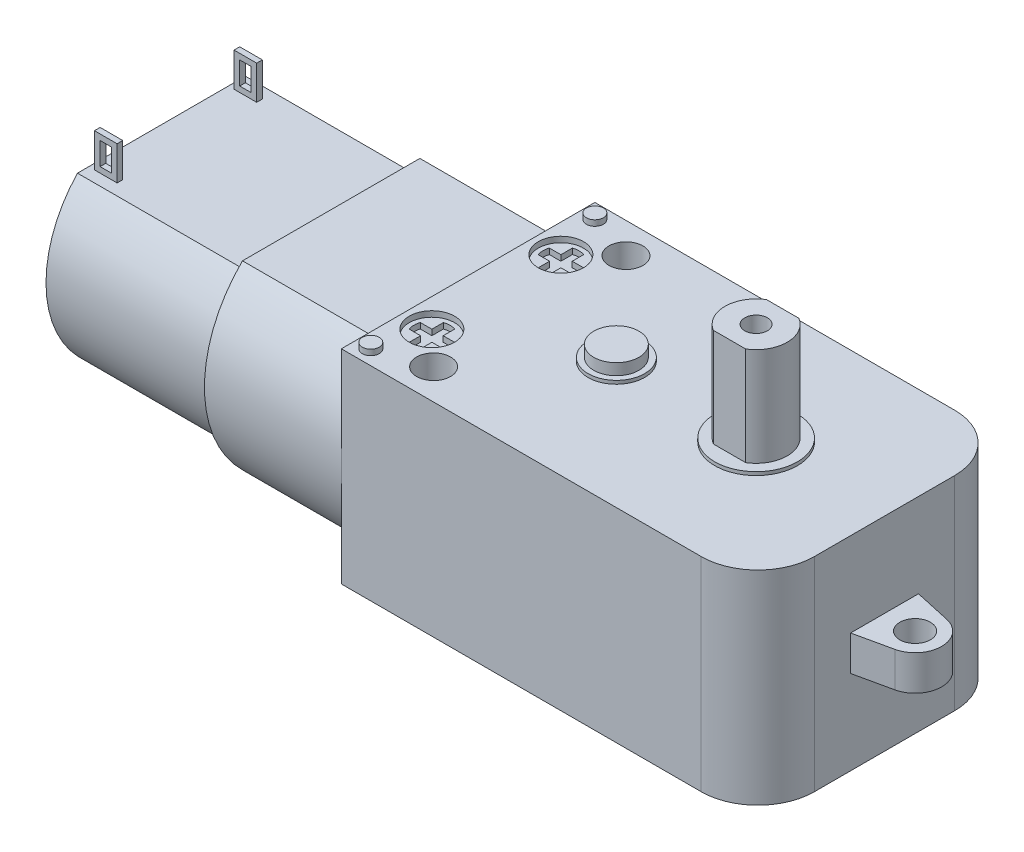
ISO-10303-21;
HEADER;
FILE_DESCRIPTION(('STEP AP214'),'2;1');
FILE_NAME('part.step','',(''),(''),'','','');
FILE_SCHEMA(('AUTOMOTIVE_DESIGN { 1 0 10303 214 1 1 1 1 }'));
ENDSEC;
DATA;
#1=APPLICATION_CONTEXT('core data for automotive mechanical design processes');
#2=APPLICATION_PROTOCOL_DEFINITION('international standard','automotive_design',2000,#1);
#3=PRODUCT_CONTEXT('',#1,'mechanical');
#4=PRODUCT('Part','Part','',(#3));
#5=PRODUCT_RELATED_PRODUCT_CATEGORY('part','',(#4));
#6=PRODUCT_DEFINITION_FORMATION('','',#4);
#7=PRODUCT_DEFINITION_CONTEXT('part definition',#1,'design');
#8=PRODUCT_DEFINITION('design','',#6,#7);
#9=PRODUCT_DEFINITION_SHAPE('','',#8);
#10=(LENGTH_UNIT() NAMED_UNIT(*) SI_UNIT(.MILLI.,.METRE.));
#11=(NAMED_UNIT(*) PLANE_ANGLE_UNIT() SI_UNIT($,.RADIAN.));
#12=(NAMED_UNIT(*) SI_UNIT($,.STERADIAN.) SOLID_ANGLE_UNIT());
#13=UNCERTAINTY_MEASURE_WITH_UNIT(LENGTH_MEASURE(1.E-05),#10,'distance_accuracy_value','');
#14=(GEOMETRIC_REPRESENTATION_CONTEXT(3) GLOBAL_UNCERTAINTY_ASSIGNED_CONTEXT((#13)) GLOBAL_UNIT_ASSIGNED_CONTEXT((#10,
#11,#12)) REPRESENTATION_CONTEXT('',''));
#15=CARTESIAN_POINT('',(0.,0.,0.));
#16=DIRECTION('',(0.,0.,1.));
#17=DIRECTION('',(1.,0.,0.));
#18=AXIS2_PLACEMENT_3D('',#15,#16,#17);
#19=CARTESIAN_POINT('',(-27.1,6.99999999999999,-3.78110520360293));
#20=DIRECTION('',(0.,-1.,0.));
#21=DIRECTION('',(0.,0.,-1.));
#22=AXIS2_PLACEMENT_3D('',#19,#20,#21);
#23=PLANE('',#22);
#24=DIRECTION('',(0.,0.,1.));
#25=VECTOR('',#24,1.);
#26=CARTESIAN_POINT('',(-26.6,7.,-17.6188947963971));
#27=LINE('',#26,#25);
#28=CARTESIAN_POINT('',(-26.6,7.,-17.6188947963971));
#29=VERTEX_POINT('',#28);
#30=CARTESIAN_POINT('',(-26.6,7.,-17.1188947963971));
#31=VERTEX_POINT('',#30);
#32=EDGE_CURVE('E523',#29,#31,#27,.T.);
#33=ORIENTED_EDGE('',*,*,#32,.F.);
#34=DIRECTION('',(-1.,0.,0.));
#35=VECTOR('',#34,1.);
#36=CARTESIAN_POINT('',(-26.6,7.,-17.6188947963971));
#37=LINE('',#36,#35);
#38=CARTESIAN_POINT('',(-24.6,7.,-17.6188947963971));
#39=VERTEX_POINT('',#38);
#40=EDGE_CURVE('E528',#39,#29,#37,.T.);
#41=ORIENTED_EDGE('',*,*,#40,.F.);
#42=DIRECTION('',(0.,0.,-1.));
#43=VECTOR('',#42,1.);
#44=CARTESIAN_POINT('',(-24.6,7.,-17.6188947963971));
#45=LINE('',#44,#43);
#46=CARTESIAN_POINT('',(-24.6,7.,-17.1188947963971));
#47=VERTEX_POINT('',#46);
#48=EDGE_CURVE('E540',#47,#39,#45,.T.);
#49=ORIENTED_EDGE('',*,*,#48,.F.);
#50=DIRECTION('',(1.,0.,0.));
#51=VECTOR('',#50,1.);
#52=CARTESIAN_POINT('',(-26.6,7.,-17.1188947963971));
#53=LINE('',#52,#51);
#54=EDGE_CURVE('E537',#31,#47,#53,.T.);
#55=ORIENTED_EDGE('',*,*,#54,.F.);
#56=EDGE_LOOP('',(#33,#41,#49,#55));
#57=FACE_BOUND('',#56,.T.);
#58=DIRECTION('',(0.,0.,-1.));
#59=VECTOR('',#58,1.);
#60=CARTESIAN_POINT('',(-12.1,6.99999999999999,-3.78110520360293));
#61=LINE('',#60,#59);
#62=CARTESIAN_POINT('',(-12.1,6.99999999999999,-3.78110520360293));
#63=VERTEX_POINT('',#62);
#64=CARTESIAN_POINT('',(-12.1,7.,-18.6188947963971));
#65=VERTEX_POINT('',#64);
#66=EDGE_CURVE('E573',#63,#65,#61,.T.);
#67=ORIENTED_EDGE('',*,*,#66,.T.);
#68=DIRECTION('',(1.,0.,0.));
#69=VECTOR('',#68,1.);
#70=CARTESIAN_POINT('',(-27.1,7.,-18.6188947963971));
#71=LINE('',#70,#69);
#72=CARTESIAN_POINT('',(-27.1,7.,-18.6188947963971));
#73=VERTEX_POINT('',#72);
#74=EDGE_CURVE('E579',#73,#65,#71,.T.);
#75=ORIENTED_EDGE('',*,*,#74,.F.);
#76=DIRECTION('',(0.,0.,-1.));
#77=VECTOR('',#76,1.);
#78=CARTESIAN_POINT('',(-27.1,6.99999999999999,-3.78110520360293));
#79=LINE('',#78,#77);
#80=CARTESIAN_POINT('',(-27.1,6.99999999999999,-3.78110520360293));
#81=VERTEX_POINT('',#80);
#82=EDGE_CURVE('E577',#81,#73,#79,.T.);
#83=ORIENTED_EDGE('',*,*,#82,.F.);
#84=DIRECTION('',(1.,0.,0.));
#85=VECTOR('',#84,1.);
#86=CARTESIAN_POINT('',(-27.1,6.99999999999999,-3.78110520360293));
#87=LINE('',#86,#85);
#88=EDGE_CURVE('E590',#81,#63,#87,.T.);
#89=ORIENTED_EDGE('',*,*,#88,.T.);
#90=EDGE_LOOP('',(#67,#75,#83,#89));
#91=FACE_BOUND('',#90,.T.);
#92=DIRECTION('',(0.,0.,1.));
#93=VECTOR('',#92,1.);
#94=CARTESIAN_POINT('',(-26.6,6.99999999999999,-5.28110520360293));
#95=LINE('',#94,#93);
#96=CARTESIAN_POINT('',(-26.6,6.99999999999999,-5.28110520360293));
#97=VERTEX_POINT('',#96);
#98=CARTESIAN_POINT('',(-26.6,6.99999999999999,-4.78110520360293));
#99=VERTEX_POINT('',#98);
#100=EDGE_CURVE('E490',#97,#99,#95,.T.);
#101=ORIENTED_EDGE('',*,*,#100,.F.);
#102=DIRECTION('',(-1.,0.,0.));
#103=VECTOR('',#102,1.);
#104=CARTESIAN_POINT('',(-26.6,6.99999999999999,-5.28110520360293));
#105=LINE('',#104,#103);
#106=CARTESIAN_POINT('',(-24.6,6.99999999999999,-5.28110520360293));
#107=VERTEX_POINT('',#106);
#108=EDGE_CURVE('E495',#107,#97,#105,.T.);
#109=ORIENTED_EDGE('',*,*,#108,.F.);
#110=DIRECTION('',(0.,0.,-1.));
#111=VECTOR('',#110,1.);
#112=CARTESIAN_POINT('',(-24.6,6.99999999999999,-5.28110520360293));
#113=LINE('',#112,#111);
#114=CARTESIAN_POINT('',(-24.6,6.99999999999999,-4.78110520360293));
#115=VERTEX_POINT('',#114);
#116=EDGE_CURVE('E507',#115,#107,#113,.T.);
#117=ORIENTED_EDGE('',*,*,#116,.F.);
#118=DIRECTION('',(1.,0.,0.));
#119=VECTOR('',#118,1.);
#120=CARTESIAN_POINT('',(-26.6,6.99999999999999,-4.78110520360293));
#121=LINE('',#120,#119);
#122=EDGE_CURVE('E504',#99,#115,#121,.T.);
#123=ORIENTED_EDGE('',*,*,#122,.F.);
#124=EDGE_LOOP('',(#101,#109,#117,#123));
#125=FACE_BOUND('',#124,.T.);
#126=ADVANCED_FACE('F35',(#57,#91,#125),#23,.F.);
#127=CARTESIAN_POINT('',(-12.1,0.,-11.2));
#128=DIRECTION('',(-1.,0.,0.));
#129=DIRECTION('',(0.,0.,1.));
#130=AXIS2_PLACEMENT_3D('',#127,#128,#129);
#131=PLANE('',#130);
#132=CARTESIAN_POINT('',(-12.1,0.,-11.2));
#133=DIRECTION('',(-1.,0.,0.));
#134=DIRECTION('',(0.,0.,1.));
#135=AXIS2_PLACEMENT_3D('',#132,#133,#134);
#136=CIRCLE('',#135,11.2);
#137=CARTESIAN_POINT('',(-12.1,8.,-19.0383671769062));
#138=VERTEX_POINT('',#137);
#139=CARTESIAN_POINT('',(-12.1,-8.,-19.0383671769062));
#140=VERTEX_POINT('',#139);
#141=EDGE_CURVE('E598',#138,#140,#136,.T.);
#142=ORIENTED_EDGE('',*,*,#141,.T.);
#143=DIRECTION('',(0.,0.,1.));
#144=VECTOR('',#143,1.);
#145=CARTESIAN_POINT('',(-12.1,-8.,-3.36163282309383));
#146=LINE('',#145,#144);
#147=CARTESIAN_POINT('',(-12.1,-8.,-3.36163282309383));
#148=VERTEX_POINT('',#147);
#149=EDGE_CURVE('E601',#140,#148,#146,.T.);
#150=ORIENTED_EDGE('',*,*,#149,.T.);
#151=CARTESIAN_POINT('',(-12.1,0.,-11.2));
#152=DIRECTION('',(-1.,0.,0.));
#153=DIRECTION('',(0.,0.,1.));
#154=AXIS2_PLACEMENT_3D('',#151,#152,#153);
#155=CIRCLE('',#154,11.2);
#156=CARTESIAN_POINT('',(-12.1,7.99999999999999,-3.36163282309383));
#157=VERTEX_POINT('',#156);
#158=EDGE_CURVE('E604',#148,#157,#155,.T.);
#159=ORIENTED_EDGE('',*,*,#158,.T.);
#160=DIRECTION('',(0.,0.,-1.));
#161=VECTOR('',#160,1.);
#162=CARTESIAN_POINT('',(-12.1,8.,-19.0383671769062));
#163=LINE('',#162,#161);
#164=EDGE_CURVE('E606',#157,#138,#163,.T.);
#165=ORIENTED_EDGE('',*,*,#164,.T.);
#166=EDGE_LOOP('',(#142,#150,#159,#165));
#167=FACE_BOUND('',#166,.T.);
#168=DIRECTION('',(0.,0.,1.));
#169=VECTOR('',#168,1.);
#170=CARTESIAN_POINT('',(-12.1,-7.,-18.6188947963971));
#171=LINE('',#170,#169);
#172=CARTESIAN_POINT('',(-12.1,-7.,-18.6188947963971));
#173=VERTEX_POINT('',#172);
#174=CARTESIAN_POINT('',(-12.1,-7.,-3.78110520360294));
#175=VERTEX_POINT('',#174);
#176=EDGE_CURVE('E582',#173,#175,#171,.T.);
#177=ORIENTED_EDGE('',*,*,#176,.F.);
#178=CARTESIAN_POINT('',(-12.1,0.,-11.2));
#179=DIRECTION('',(-1.,0.,0.));
#180=DIRECTION('',(0.,0.,1.));
#181=AXIS2_PLACEMENT_3D('',#178,#179,#180);
#182=CIRCLE('',#181,10.2000000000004);
#183=EDGE_CURVE('E566',#65,#173,#182,.T.);
#184=ORIENTED_EDGE('',*,*,#183,.F.);
#185=ORIENTED_EDGE('',*,*,#66,.F.);
#186=CARTESIAN_POINT('',(-12.1,0.,-11.2));
#187=DIRECTION('',(-1.,0.,0.));
#188=DIRECTION('',(0.,0.,1.));
#189=AXIS2_PLACEMENT_3D('',#186,#187,#188);
#190=CIRCLE('',#189,10.2000000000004);
#191=EDGE_CURVE('E584',#175,#63,#190,.T.);
#192=ORIENTED_EDGE('',*,*,#191,.F.);
#193=EDGE_LOOP('',(#177,#184,#185,#192));
#194=FACE_BOUND('',#193,.T.);
#195=ADVANCED_FACE('F1022',(#167,#194),#131,.T.);
#196=CARTESIAN_POINT('',(0.,9.,0.));
#197=DIRECTION('',(1.,0.,0.));
#198=DIRECTION('',(0.,0.,-1.));
#199=AXIS2_PLACEMENT_3D('',#196,#197,#198);
#200=PLANE('',#199);
#201=DIRECTION('',(0.,0.,-1.));
#202=VECTOR('',#201,1.);
#203=CARTESIAN_POINT('',(0.,8.,-19.0383671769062));
#204=LINE('',#203,#202);
#205=CARTESIAN_POINT('',(0.,7.99999999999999,-3.36163282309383));
#206=VERTEX_POINT('',#205);
#207=CARTESIAN_POINT('',(0.,8.,-19.0383671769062));
#208=VERTEX_POINT('',#207);
#209=EDGE_CURVE('E602',#206,#208,#204,.T.);
#210=ORIENTED_EDGE('',*,*,#209,.F.);
#211=CARTESIAN_POINT('',(0.,0.,-11.2));
#212=DIRECTION('',(-1.,0.,0.));
#213=DIRECTION('',(0.,0.,1.));
#214=AXIS2_PLACEMENT_3D('',#211,#212,#213);
#215=CIRCLE('',#214,11.2);
#216=CARTESIAN_POINT('',(0.,0.,0.));
#217=VERTEX_POINT('',#216);
#218=EDGE_CURVE('E618',#217,#206,#215,.T.);
#219=ORIENTED_EDGE('',*,*,#218,.F.);
#220=DIRECTION('',(0.,-1.,0.));
#221=VECTOR('',#220,1.);
#222=CARTESIAN_POINT('',(0.,9.,0.));
#223=LINE('',#222,#221);
#224=CARTESIAN_POINT('',(0.,9.,0.));
#225=VERTEX_POINT('',#224);
#226=EDGE_CURVE('E962',#225,#217,#223,.T.);
#227=ORIENTED_EDGE('',*,*,#226,.F.);
#228=DIRECTION('',(0.,0.,1.));
#229=VECTOR('',#228,1.);
#230=CARTESIAN_POINT('',(0.,9.,0.));
#231=LINE('',#230,#229);
#232=CARTESIAN_POINT('',(0.,9.,-22.4));
#233=VERTEX_POINT('',#232);
#234=EDGE_CURVE('E935',#233,#225,#231,.T.);
#235=ORIENTED_EDGE('',*,*,#234,.F.);
#236=DIRECTION('',(0.,-1.,0.));
#237=VECTOR('',#236,1.);
#238=CARTESIAN_POINT('',(0.,9.,-22.4));
#239=LINE('',#238,#237);
#240=CARTESIAN_POINT('',(0.,0.,-22.4));
#241=VERTEX_POINT('',#240);
#242=EDGE_CURVE('E958',#233,#241,#239,.T.);
#243=ORIENTED_EDGE('',*,*,#242,.T.);
#244=CARTESIAN_POINT('',(0.,0.,-11.2));
#245=DIRECTION('',(-1.,0.,0.));
#246=DIRECTION('',(0.,0.,1.));
#247=AXIS2_PLACEMENT_3D('',#244,#245,#246);
#248=CIRCLE('',#247,11.2);
#249=EDGE_CURVE('E597',#208,#241,#248,.T.);
#250=ORIENTED_EDGE('',*,*,#249,.F.);
#251=EDGE_LOOP('',(#210,#219,#227,#235,#243,#250));
#252=FACE_BOUND('',#251,.T.);
#253=ADVANCED_FACE('F1028',(#252),#200,.F.);
#254=CARTESIAN_POINT('',(0.,-8.,-19.0383671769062));
#255=VERTEX_POINT('',#254);
#256=EDGE_CURVE('E612',#241,#255,#248,.T.);
#257=ORIENTED_EDGE('',*,*,#256,.F.);
#258=CARTESIAN_POINT('',(0.,-9.,-22.4));
#259=VERTEX_POINT('',#258);
#260=EDGE_CURVE('E947',#241,#259,#239,.T.);
#261=ORIENTED_EDGE('',*,*,#260,.T.);
#262=DIRECTION('',(0.,0.,1.));
#263=VECTOR('',#262,1.);
#264=CARTESIAN_POINT('',(0.,-9.,0.));
#265=LINE('',#264,#263);
#266=CARTESIAN_POINT('',(0.,-9.,0.));
#267=VERTEX_POINT('',#266);
#268=EDGE_CURVE('E934',#259,#267,#265,.T.);
#269=ORIENTED_EDGE('',*,*,#268,.T.);
#270=EDGE_CURVE('E961',#217,#267,#223,.T.);
#271=ORIENTED_EDGE('',*,*,#270,.F.);
#272=CARTESIAN_POINT('',(0.,-8.,-3.36163282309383));
#273=VERTEX_POINT('',#272);
#274=EDGE_CURVE('E615',#273,#217,#215,.T.);
#275=ORIENTED_EDGE('',*,*,#274,.F.);
#276=DIRECTION('',(0.,0.,1.));
#277=VECTOR('',#276,1.);
#278=CARTESIAN_POINT('',(0.,-8.,-3.36163282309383));
#279=LINE('',#278,#277);
#280=EDGE_CURVE('E611',#255,#273,#279,.T.);
#281=ORIENTED_EDGE('',*,*,#280,.F.);
#282=EDGE_LOOP('',(#257,#261,#269,#271,#275,#281));
#283=FACE_BOUND('',#282,.T.);
#284=ADVANCED_FACE('F1298',(#283),#200,.F.);
#285=CARTESIAN_POINT('',(36.8,9.,0.));
#286=DIRECTION('',(-1.,0.,0.));
#287=DIRECTION('',(0.,0.,1.));
#288=AXIS2_PLACEMENT_3D('',#285,#286,#287);
#289=PLANE('',#288);
#290=DIRECTION('',(0.,0.,-1.));
#291=VECTOR('',#290,1.);
#292=CARTESIAN_POINT('',(36.8,-9.,0.));
#293=LINE('',#292,#291);
#294=CARTESIAN_POINT('',(36.8,-9.,-5.));
#295=VERTEX_POINT('',#294);
#296=CARTESIAN_POINT('',(36.8,-9.,-17.4));
#297=VERTEX_POINT('',#296);
#298=EDGE_CURVE('E953',#295,#297,#293,.T.);
#299=ORIENTED_EDGE('',*,*,#298,.T.);
#300=DIRECTION('',(0.,-1.,0.));
#301=VECTOR('',#300,1.);
#302=CARTESIAN_POINT('',(36.8,9.,-17.4));
#303=LINE('',#302,#301);
#304=CARTESIAN_POINT('',(36.8,9.,-17.4));
#305=VERTEX_POINT('',#304);
#306=EDGE_CURVE('E975',#297,#305,#303,.F.);
#307=ORIENTED_EDGE('',*,*,#306,.T.);
#308=DIRECTION('',(0.,0.,-1.));
#309=VECTOR('',#308,1.);
#310=CARTESIAN_POINT('',(36.8,9.,0.));
#311=LINE('',#310,#309);
#312=CARTESIAN_POINT('',(36.8,9.,-5.));
#313=VERTEX_POINT('',#312);
#314=EDGE_CURVE('E942',#313,#305,#311,.T.);
#315=ORIENTED_EDGE('',*,*,#314,.F.);
#316=DIRECTION('',(0.,-1.,0.));
#317=VECTOR('',#316,1.);
#318=CARTESIAN_POINT('',(36.8,9.,-5.));
#319=LINE('',#318,#317);
#320=EDGE_CURVE('E972',#313,#295,#319,.T.);
#321=ORIENTED_EDGE('',*,*,#320,.T.);
#322=EDGE_LOOP('',(#299,#307,#315,#321));
#323=FACE_BOUND('',#322,.T.);
#324=DIRECTION('',(0.,-1.,0.));
#325=VECTOR('',#324,1.);
#326=CARTESIAN_POINT('',(36.8,1.55,-8.2));
#327=LINE('',#326,#325);
#328=CARTESIAN_POINT('',(36.8,1.55,-8.2));
#329=VERTEX_POINT('',#328);
#330=CARTESIAN_POINT('',(36.8,-1.55,-8.2));
#331=VERTEX_POINT('',#330);
#332=EDGE_CURVE('E931',#329,#331,#327,.T.);
#333=ORIENTED_EDGE('',*,*,#332,.F.);
#334=DIRECTION('',(0.,0.,1.));
#335=VECTOR('',#334,1.);
#336=CARTESIAN_POINT('',(36.8,1.55,-14.2));
#337=LINE('',#336,#335);
#338=CARTESIAN_POINT('',(36.8,1.55,-14.2));
#339=VERTEX_POINT('',#338);
#340=EDGE_CURVE('E905',#339,#329,#337,.T.);
#341=ORIENTED_EDGE('',*,*,#340,.F.);
#342=DIRECTION('',(0.,-1.,0.));
#343=VECTOR('',#342,1.);
#344=CARTESIAN_POINT('',(36.8,1.55,-14.2));
#345=LINE('',#344,#343);
#346=CARTESIAN_POINT('',(36.8,-1.55,-14.2));
#347=VERTEX_POINT('',#346);
#348=EDGE_CURVE('E916',#339,#347,#345,.T.);
#349=ORIENTED_EDGE('',*,*,#348,.T.);
#350=DIRECTION('',(0.,0.,1.));
#351=VECTOR('',#350,1.);
#352=CARTESIAN_POINT('',(36.8,-1.55,-14.2));
#353=LINE('',#352,#351);
#354=EDGE_CURVE('E902',#347,#331,#353,.T.);
#355=ORIENTED_EDGE('',*,*,#354,.T.);
#356=EDGE_LOOP('',(#333,#341,#349,#355));
#357=FACE_BOUND('',#356,.T.);
#358=ADVANCED_FACE('F1295',(#323,#357),#289,.F.);
#359=CARTESIAN_POINT('',(0.,9.,0.));
#360=DIRECTION('',(0.,0.,-1.));
#361=DIRECTION('',(-1.,0.,0.));
#362=AXIS2_PLACEMENT_3D('',#359,#360,#361);
#363=PLANE('',#362);
#364=DIRECTION('',(1.,0.,0.));
#365=VECTOR('',#364,1.);
#366=CARTESIAN_POINT('',(0.,-9.,0.));
#367=LINE('',#366,#365);
#368=CARTESIAN_POINT('',(31.8,-9.,0.));
#369=VERTEX_POINT('',#368);
#370=EDGE_CURVE('E950',#267,#369,#367,.T.);
#371=ORIENTED_EDGE('',*,*,#370,.T.);
#372=DIRECTION('',(0.,-1.,0.));
#373=VECTOR('',#372,1.);
#374=CARTESIAN_POINT('',(31.8,9.,0.));
#375=LINE('',#374,#373);
#376=CARTESIAN_POINT('',(31.8,9.,0.));
#377=VERTEX_POINT('',#376);
#378=EDGE_CURVE('E981',#369,#377,#375,.F.);
#379=ORIENTED_EDGE('',*,*,#378,.T.);
#380=DIRECTION('',(1.,0.,0.));
#381=VECTOR('',#380,1.);
#382=CARTESIAN_POINT('',(0.,9.,0.));
#383=LINE('',#382,#381);
#384=EDGE_CURVE('E938',#225,#377,#383,.T.);
#385=ORIENTED_EDGE('',*,*,#384,.F.);
#386=ORIENTED_EDGE('',*,*,#226,.T.);
#387=ORIENTED_EDGE('',*,*,#270,.T.);
#388=EDGE_LOOP('',(#371,#379,#385,#386,#387));
#389=FACE_BOUND('',#388,.T.);
#390=ADVANCED_FACE('F1293',(#389),#363,.F.);
#391=CARTESIAN_POINT('',(0.,9.,-22.4));
#392=DIRECTION('',(0.,0.,1.));
#393=DIRECTION('',(1.,0.,0.));
#394=AXIS2_PLACEMENT_3D('',#391,#392,#393);
#395=PLANE('',#394);
#396=DIRECTION('',(-1.,0.,0.));
#397=VECTOR('',#396,1.);
#398=CARTESIAN_POINT('',(0.,9.,-22.4));
#399=LINE('',#398,#397);
#400=CARTESIAN_POINT('',(31.8,9.,-22.4));
#401=VERTEX_POINT('',#400);
#402=EDGE_CURVE('E945',#401,#233,#399,.T.);
#403=ORIENTED_EDGE('',*,*,#402,.F.);
#404=DIRECTION('',(0.,-1.,0.));
#405=VECTOR('',#404,1.);
#406=CARTESIAN_POINT('',(31.8,9.,-22.4));
#407=LINE('',#406,#405);
#408=CARTESIAN_POINT('',(31.8,-9.,-22.4));
#409=VERTEX_POINT('',#408);
#410=EDGE_CURVE('E965',#401,#409,#407,.T.);
#411=ORIENTED_EDGE('',*,*,#410,.T.);
#412=DIRECTION('',(-1.,0.,0.));
#413=VECTOR('',#412,1.);
#414=CARTESIAN_POINT('',(0.,-9.,-22.4));
#415=LINE('',#414,#413);
#416=EDGE_CURVE('E939',#409,#259,#415,.T.);
#417=ORIENTED_EDGE('',*,*,#416,.T.);
#418=ORIENTED_EDGE('',*,*,#260,.F.);
#419=ORIENTED_EDGE('',*,*,#242,.F.);
#420=EDGE_LOOP('',(#403,#411,#417,#418,#419));
#421=FACE_BOUND('',#420,.T.);
#422=ADVANCED_FACE('F1285',(#421),#395,.F.);
#423=CARTESIAN_POINT('',(0.,9.,-22.4));
#424=DIRECTION('',(0.,-1.,0.));
#425=DIRECTION('',(0.,0.,-1.));
#426=AXIS2_PLACEMENT_3D('',#423,#424,#425);
#427=PLANE('',#426);
#428=CARTESIAN_POINT('',(1.3,9.,-1.3));
#429=DIRECTION('',(0.,-1.,0.));
#430=DIRECTION('',(0.,0.,-1.));
#431=AXIS2_PLACEMENT_3D('',#428,#429,#430);
#432=CIRCLE('',#431,0.75);
#433=CARTESIAN_POINT('',(1.3,9.,-2.05));
#434=VERTEX_POINT('',#433);
#435=EDGE_CURVE('E995',#434,#434,#432,.F.);
#436=ORIENTED_EDGE('',*,*,#435,.F.);
#437=EDGE_LOOP('',(#436));
#438=FACE_BOUND('',#437,.T.);
#439=CARTESIAN_POINT('',(1.3,9.,-21.1));
#440=DIRECTION('',(0.,-1.,0.));
#441=DIRECTION('',(0.,0.,-1.));
#442=AXIS2_PLACEMENT_3D('',#439,#440,#441);
#443=CIRCLE('',#442,0.75);
#444=CARTESIAN_POINT('',(1.3,9.,-21.85));
#445=VERTEX_POINT('',#444);
#446=EDGE_CURVE('E992',#445,#445,#443,.F.);
#447=ORIENTED_EDGE('',*,*,#446,.F.);
#448=EDGE_LOOP('',(#447));
#449=FACE_BOUND('',#448,.T.);
#450=CARTESIAN_POINT('',(2.5,9.,-5.5));
#451=DIRECTION('',(0.,1.,0.));
#452=DIRECTION('',(0.,0.,1.));
#453=AXIS2_PLACEMENT_3D('',#450,#451,#452);
#454=CIRCLE('',#453,2.);
#455=CARTESIAN_POINT('',(2.5,9.,-3.5));
#456=VERTEX_POINT('',#455);
#457=EDGE_CURVE('E808',#456,#456,#454,.T.);
#458=ORIENTED_EDGE('',*,*,#457,.F.);
#459=EDGE_LOOP('',(#458));
#460=FACE_BOUND('',#459,.T.);
#461=CARTESIAN_POINT('',(2.5,9.,-16.9));
#462=DIRECTION('',(0.,1.,0.));
#463=DIRECTION('',(0.,0.,1.));
#464=AXIS2_PLACEMENT_3D('',#461,#462,#463);
#465=CIRCLE('',#464,2.);
#466=CARTESIAN_POINT('',(2.5,9.,-14.9));
#467=VERTEX_POINT('',#466);
#468=EDGE_CURVE('E834',#467,#467,#465,.T.);
#469=ORIENTED_EDGE('',*,*,#468,.F.);
#470=EDGE_LOOP('',(#469));
#471=FACE_BOUND('',#470,.T.);
#472=CARTESIAN_POINT('',(5.44999999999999,9.,-2.7));
#473=DIRECTION('',(0.,1.,0.));
#474=DIRECTION('',(0.,0.,1.));
#475=AXIS2_PLACEMENT_3D('',#472,#473,#474);
#476=CIRCLE('',#475,1.5);
#477=CARTESIAN_POINT('',(5.44999999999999,9.,-1.2));
#478=VERTEX_POINT('',#477);
#479=EDGE_CURVE('E840',#478,#478,#476,.T.);
#480=ORIENTED_EDGE('',*,*,#479,.F.);
#481=EDGE_LOOP('',(#480));
#482=FACE_BOUND('',#481,.T.);
#483=CARTESIAN_POINT('',(5.44999999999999,9.,-19.7));
#484=DIRECTION('',(0.,1.,0.));
#485=DIRECTION('',(0.,0.,1.));
#486=AXIS2_PLACEMENT_3D('',#483,#484,#485);
#487=CIRCLE('',#486,1.5);
#488=CARTESIAN_POINT('',(5.44999999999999,9.,-18.2));
#489=VERTEX_POINT('',#488);
#490=EDGE_CURVE('E846',#489,#489,#487,.T.);
#491=ORIENTED_EDGE('',*,*,#490,.F.);
#492=EDGE_LOOP('',(#491));
#493=FACE_BOUND('',#492,.T.);
#494=CARTESIAN_POINT('',(13.1,9.,-11.2));
#495=DIRECTION('',(0.,-1.,0.));
#496=DIRECTION('',(0.,0.,-1.));
#497=AXIS2_PLACEMENT_3D('',#494,#495,#496);
#498=CIRCLE('',#497,2.5);
#499=CARTESIAN_POINT('',(13.1,9.,-13.7));
#500=VERTEX_POINT('',#499);
#501=EDGE_CURVE('E986',#500,#500,#498,.F.);
#502=ORIENTED_EDGE('',*,*,#501,.F.);
#503=EDGE_LOOP('',(#502));
#504=FACE_BOUND('',#503,.T.);
#505=CARTESIAN_POINT('',(25.45,9.,-11.2));
#506=DIRECTION('',(0.,-1.,0.));
#507=DIRECTION('',(0.,0.,-1.));
#508=AXIS2_PLACEMENT_3D('',#505,#506,#507);
#509=CIRCLE('',#508,3.65);
#510=CARTESIAN_POINT('',(25.45,9.,-14.85));
#511=VERTEX_POINT('',#510);
#512=EDGE_CURVE('E983',#511,#511,#509,.F.);
#513=ORIENTED_EDGE('',*,*,#512,.F.);
#514=EDGE_LOOP('',(#513));
#515=FACE_BOUND('',#514,.T.);
#516=ORIENTED_EDGE('',*,*,#314,.T.);
#517=CARTESIAN_POINT('',(31.8,9.,-17.4));
#518=DIRECTION('',(0.,-1.,0.));
#519=DIRECTION('',(0.,0.,-1.));
#520=AXIS2_PLACEMENT_3D('',#517,#518,#519);
#521=CIRCLE('',#520,5.);
#522=EDGE_CURVE('E979',#305,#401,#521,.F.);
#523=ORIENTED_EDGE('',*,*,#522,.T.);
#524=ORIENTED_EDGE('',*,*,#402,.T.);
#525=ORIENTED_EDGE('',*,*,#234,.T.);
#526=ORIENTED_EDGE('',*,*,#384,.T.);
#527=CARTESIAN_POINT('',(31.8,9.,-5.));
#528=DIRECTION('',(0.,-1.,0.));
#529=DIRECTION('',(0.,0.,-1.));
#530=AXIS2_PLACEMENT_3D('',#527,#528,#529);
#531=CIRCLE('',#530,5.);
#532=EDGE_CURVE('E977',#377,#313,#531,.F.);
#533=ORIENTED_EDGE('',*,*,#532,.T.);
#534=EDGE_LOOP('',(#516,#523,#524,#525,#526,#533));
#535=FACE_BOUND('',#534,.T.);
#536=ADVANCED_FACE('F1281',(#438,#449,#460,#471,#482,#493,#504,#515,#535),#427,.F.);
#537=CARTESIAN_POINT('',(0.,-9.,-22.4));
#538=DIRECTION('',(0.,-1.,0.));
#539=DIRECTION('',(0.,0.,-1.));
#540=AXIS2_PLACEMENT_3D('',#537,#538,#539);
#541=PLANE('',#540);
#542=CARTESIAN_POINT('',(5.44999999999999,-9.,-2.7));
#543=DIRECTION('',(0.,1.,0.));
#544=DIRECTION('',(0.,0.,1.));
#545=AXIS2_PLACEMENT_3D('',#542,#543,#544);
#546=CIRCLE('',#545,1.5);
#547=CARTESIAN_POINT('',(5.44999999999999,-9.,-1.2));
#548=VERTEX_POINT('',#547);
#549=EDGE_CURVE('E843',#548,#548,#546,.T.);
#550=ORIENTED_EDGE('',*,*,#549,.T.);
#551=EDGE_LOOP('',(#550));
#552=FACE_BOUND('',#551,.T.);
#553=CARTESIAN_POINT('',(5.44999999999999,-9.,-19.7));
#554=DIRECTION('',(0.,1.,0.));
#555=DIRECTION('',(0.,0.,1.));
#556=AXIS2_PLACEMENT_3D('',#553,#554,#555);
#557=CIRCLE('',#556,1.5);
#558=CARTESIAN_POINT('',(5.44999999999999,-9.,-18.2));
#559=VERTEX_POINT('',#558);
#560=EDGE_CURVE('E849',#559,#559,#557,.T.);
#561=ORIENTED_EDGE('',*,*,#560,.T.);
#562=EDGE_LOOP('',(#561));
#563=FACE_BOUND('',#562,.T.);
#564=ORIENTED_EDGE('',*,*,#416,.F.);
#565=CARTESIAN_POINT('',(31.8,-9.,-17.4));
#566=DIRECTION('',(0.,-1.,0.));
#567=DIRECTION('',(0.,0.,-1.));
#568=AXIS2_PLACEMENT_3D('',#565,#566,#567);
#569=CIRCLE('',#568,5.);
#570=EDGE_CURVE('E970',#409,#297,#569,.T.);
#571=ORIENTED_EDGE('',*,*,#570,.T.);
#572=ORIENTED_EDGE('',*,*,#298,.F.);
#573=CARTESIAN_POINT('',(31.8,-9.,-5.));
#574=DIRECTION('',(0.,-1.,0.));
#575=DIRECTION('',(0.,0.,-1.));
#576=AXIS2_PLACEMENT_3D('',#573,#574,#575);
#577=CIRCLE('',#576,5.);
#578=EDGE_CURVE('E968',#295,#369,#577,.T.);
#579=ORIENTED_EDGE('',*,*,#578,.T.);
#580=ORIENTED_EDGE('',*,*,#370,.F.);
#581=ORIENTED_EDGE('',*,*,#268,.F.);
#582=EDGE_LOOP('',(#564,#571,#572,#579,#580,#581));
#583=FACE_BOUND('',#582,.T.);
#584=ADVANCED_FACE('F1284',(#552,#563,#583),#541,.T.);
#585=CARTESIAN_POINT('',(31.8,9.,-17.4));
#586=DIRECTION('',(0.,-1.,0.));
#587=DIRECTION('',(0.,0.,-1.));
#588=AXIS2_PLACEMENT_3D('',#585,#586,#587);
#589=CYLINDRICAL_SURFACE('',#588,5.);
#590=ORIENTED_EDGE('',*,*,#522,.F.);
#591=ORIENTED_EDGE('',*,*,#306,.F.);
#592=ORIENTED_EDGE('',*,*,#570,.F.);
#593=ORIENTED_EDGE('',*,*,#410,.F.);
#594=EDGE_LOOP('',(#590,#591,#592,#593));
#595=FACE_BOUND('',#594,.T.);
#596=ADVANCED_FACE('F1289',(#595),#589,.T.);
#597=CARTESIAN_POINT('',(31.8,9.,-5.));
#598=DIRECTION('',(0.,-1.,0.));
#599=DIRECTION('',(0.,0.,-1.));
#600=AXIS2_PLACEMENT_3D('',#597,#598,#599);
#601=CYLINDRICAL_SURFACE('',#600,5.);
#602=ORIENTED_EDGE('',*,*,#532,.F.);
#603=ORIENTED_EDGE('',*,*,#378,.F.);
#604=ORIENTED_EDGE('',*,*,#578,.F.);
#605=ORIENTED_EDGE('',*,*,#320,.F.);
#606=EDGE_LOOP('',(#602,#603,#604,#605));
#607=FACE_BOUND('',#606,.T.);
#608=ADVANCED_FACE('F37',(#607),#601,.T.);
#609=CARTESIAN_POINT('',(39.5,1.55,-11.2));
#610=DIRECTION('',(0.,1.,0.));
#611=DIRECTION('',(0.,0.,1.));
#612=AXIS2_PLACEMENT_3D('',#609,#610,#611);
#613=PLANE('',#612);
#614=ORIENTED_EDGE('',*,*,#340,.T.);
#615=DIRECTION('',(0.976657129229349,0.,-0.214804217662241));
#616=VECTOR('',#615,1.);
#617=CARTESIAN_POINT('',(36.8,1.55,-8.2));
#618=LINE('',#617,#616);
#619=CARTESIAN_POINT('',(40.0047899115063,1.55,-8.90485574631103));
#620=VERTEX_POINT('',#619);
#621=EDGE_CURVE('E908',#329,#620,#618,.T.);
#622=ORIENTED_EDGE('',*,*,#621,.T.);
#623=CARTESIAN_POINT('',(39.5,1.55,-11.2));
#624=DIRECTION('',(0.,1.,0.));
#625=DIRECTION('',(0.,0.,1.));
#626=AXIS2_PLACEMENT_3D('',#623,#624,#625);
#627=CIRCLE('',#626,2.35);
#628=CARTESIAN_POINT('',(40.0047899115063,1.55,-13.495144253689));
#629=VERTEX_POINT('',#628);
#630=EDGE_CURVE('E911',#620,#629,#627,.T.);
#631=ORIENTED_EDGE('',*,*,#630,.T.);
#632=DIRECTION('',(-0.976657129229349,0.,-0.21480421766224));
#633=VECTOR('',#632,1.);
#634=CARTESIAN_POINT('',(36.8,1.55,-14.2));
#635=LINE('',#634,#633);
#636=EDGE_CURVE('E913',#629,#339,#635,.T.);
#637=ORIENTED_EDGE('',*,*,#636,.T.);
#638=EDGE_LOOP('',(#614,#622,#631,#637));
#639=FACE_BOUND('',#638,.T.);
#640=CARTESIAN_POINT('',(39.5,1.55,-11.2));
#641=DIRECTION('',(0.,1.,0.));
#642=DIRECTION('',(0.,0.,1.));
#643=AXIS2_PLACEMENT_3D('',#640,#641,#642);
#644=CIRCLE('',#643,1.35);
#645=CARTESIAN_POINT('',(39.5,1.55,-12.55));
#646=VERTEX_POINT('',#645);
#647=EDGE_CURVE('E899',#646,#646,#644,.T.);
#648=ORIENTED_EDGE('',*,*,#647,.F.);
#649=EDGE_LOOP('',(#648));
#650=FACE_BOUND('',#649,.T.);
#651=ADVANCED_FACE('F1262',(#639,#650),#613,.T.);
#652=CARTESIAN_POINT('',(39.5,-1.55,-11.2));
#653=DIRECTION('',(0.,1.,0.));
#654=DIRECTION('',(0.,0.,1.));
#655=AXIS2_PLACEMENT_3D('',#652,#653,#654);
#656=PLANE('',#655);
#657=ORIENTED_EDGE('',*,*,#354,.F.);
#658=DIRECTION('',(-0.976657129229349,0.,-0.21480421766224));
#659=VECTOR('',#658,1.);
#660=CARTESIAN_POINT('',(36.8,-1.55,-14.2));
#661=LINE('',#660,#659);
#662=CARTESIAN_POINT('',(40.0047899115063,-1.55,-13.495144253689));
#663=VERTEX_POINT('',#662);
#664=EDGE_CURVE('E909',#663,#347,#661,.T.);
#665=ORIENTED_EDGE('',*,*,#664,.F.);
#666=CARTESIAN_POINT('',(39.5,-1.55,-11.2));
#667=DIRECTION('',(0.,1.,0.));
#668=DIRECTION('',(0.,0.,1.));
#669=AXIS2_PLACEMENT_3D('',#666,#667,#668);
#670=CIRCLE('',#669,2.35);
#671=CARTESIAN_POINT('',(40.0047899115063,-1.55,-8.90485574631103));
#672=VERTEX_POINT('',#671);
#673=EDGE_CURVE('E920',#672,#663,#670,.T.);
#674=ORIENTED_EDGE('',*,*,#673,.F.);
#675=DIRECTION('',(0.976657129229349,0.,-0.214804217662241));
#676=VECTOR('',#675,1.);
#677=CARTESIAN_POINT('',(36.8,-1.55,-8.2));
#678=LINE('',#677,#676);
#679=EDGE_CURVE('E918',#331,#672,#678,.T.);
#680=ORIENTED_EDGE('',*,*,#679,.F.);
#681=EDGE_LOOP('',(#657,#665,#674,#680));
#682=FACE_BOUND('',#681,.T.);
#683=CARTESIAN_POINT('',(39.5,-1.55,-11.2));
#684=DIRECTION('',(0.,1.,0.));
#685=DIRECTION('',(0.,0.,1.));
#686=AXIS2_PLACEMENT_3D('',#683,#684,#685);
#687=CIRCLE('',#686,1.35);
#688=CARTESIAN_POINT('',(39.5,-1.55,-12.55));
#689=VERTEX_POINT('',#688);
#690=EDGE_CURVE('E898',#689,#689,#687,.T.);
#691=ORIENTED_EDGE('',*,*,#690,.T.);
#692=EDGE_LOOP('',(#691));
#693=FACE_BOUND('',#692,.T.);
#694=ADVANCED_FACE('F1265',(#682,#693),#656,.F.);
#695=CARTESIAN_POINT('',(36.8,1.55,-8.2));
#696=DIRECTION('',(-0.214804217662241,0.,-0.976657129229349));
#697=DIRECTION('',(-0.976657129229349,0.,0.214804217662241));
#698=AXIS2_PLACEMENT_3D('',#695,#696,#697);
#699=PLANE('',#698);
#700=ORIENTED_EDGE('',*,*,#679,.T.);
#701=DIRECTION('',(0.,-1.,0.));
#702=VECTOR('',#701,1.);
#703=CARTESIAN_POINT('',(40.0047899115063,1.55,-8.90485574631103));
#704=LINE('',#703,#702);
#705=EDGE_CURVE('E928',#620,#672,#704,.T.);
#706=ORIENTED_EDGE('',*,*,#705,.F.);
#707=ORIENTED_EDGE('',*,*,#621,.F.);
#708=ORIENTED_EDGE('',*,*,#332,.T.);
#709=EDGE_LOOP('',(#700,#706,#707,#708));
#710=FACE_BOUND('',#709,.T.);
#711=ADVANCED_FACE('F1269',(#710),#699,.F.);
#712=CARTESIAN_POINT('',(39.5,1.55,-11.2));
#713=DIRECTION('',(0.,-1.,0.));
#714=DIRECTION('',(0.,0.,-1.));
#715=AXIS2_PLACEMENT_3D('',#712,#713,#714);
#716=CYLINDRICAL_SURFACE('',#715,2.35);
#717=ORIENTED_EDGE('',*,*,#673,.T.);
#718=DIRECTION('',(0.,-1.,0.));
#719=VECTOR('',#718,1.);
#720=CARTESIAN_POINT('',(40.0047899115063,1.55,-13.495144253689));
#721=LINE('',#720,#719);
#722=EDGE_CURVE('E925',#629,#663,#721,.T.);
#723=ORIENTED_EDGE('',*,*,#722,.F.);
#724=ORIENTED_EDGE('',*,*,#630,.F.);
#725=ORIENTED_EDGE('',*,*,#705,.T.);
#726=EDGE_LOOP('',(#717,#723,#724,#725));
#727=FACE_BOUND('',#726,.T.);
#728=ADVANCED_FACE('F1273',(#727),#716,.T.);
#729=CARTESIAN_POINT('',(36.8,1.55,-14.2));
#730=DIRECTION('',(-0.21480421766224,0.,0.976657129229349));
#731=DIRECTION('',(0.976657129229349,0.,0.21480421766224));
#732=AXIS2_PLACEMENT_3D('',#729,#730,#731);
#733=PLANE('',#732);
#734=ORIENTED_EDGE('',*,*,#664,.T.);
#735=ORIENTED_EDGE('',*,*,#348,.F.);
#736=ORIENTED_EDGE('',*,*,#636,.F.);
#737=ORIENTED_EDGE('',*,*,#722,.T.);
#738=EDGE_LOOP('',(#734,#735,#736,#737));
#739=FACE_BOUND('',#738,.T.);
#740=ADVANCED_FACE('F1260',(#739),#733,.F.);
#741=CARTESIAN_POINT('',(39.5,1.55,-11.2));
#742=DIRECTION('',(0.,-1.,0.));
#743=DIRECTION('',(0.,0.,-1.));
#744=AXIS2_PLACEMENT_3D('',#741,#742,#743);
#745=CYLINDRICAL_SURFACE('',#744,1.35);
#746=CARTESIAN_POINT('',(39.5,1.55,-12.55));
#747=CARTESIAN_POINT('',(39.5,1.51770833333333,-12.55));
#748=CARTESIAN_POINT('',(39.5,1.48541666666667,-12.55));
#749=CARTESIAN_POINT('',(39.5,1.42083333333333,-12.55));
#750=CARTESIAN_POINT('',(39.5,1.38854166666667,-12.55));
#751=CARTESIAN_POINT('',(39.5,1.32395833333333,-12.55));
#752=CARTESIAN_POINT('',(39.5,1.29166666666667,-12.55));
#753=CARTESIAN_POINT('',(39.5,1.22708333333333,-12.55));
#754=CARTESIAN_POINT('',(39.5,1.19479166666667,-12.55));
#755=CARTESIAN_POINT('',(39.5,1.13020833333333,-12.55));
#756=CARTESIAN_POINT('',(39.5,1.09791666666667,-12.55));
#757=CARTESIAN_POINT('',(39.5,1.03333333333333,-12.55));
#758=CARTESIAN_POINT('',(39.5,1.00104166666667,-12.55));
#759=CARTESIAN_POINT('',(39.5,0.936458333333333,-12.55));
#760=CARTESIAN_POINT('',(39.5,0.904166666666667,-12.55));
#761=CARTESIAN_POINT('',(39.5,0.839583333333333,-12.55));
#762=CARTESIAN_POINT('',(39.5,0.807291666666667,-12.55));
#763=CARTESIAN_POINT('',(39.5,0.742708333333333,-12.55));
#764=CARTESIAN_POINT('',(39.5,0.710416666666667,-12.55));
#765=CARTESIAN_POINT('',(39.5,0.645833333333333,-12.55));
#766=CARTESIAN_POINT('',(39.5,0.613541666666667,-12.55));
#767=CARTESIAN_POINT('',(39.5,0.548958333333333,-12.55));
#768=CARTESIAN_POINT('',(39.5,0.516666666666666,-12.55));
#769=CARTESIAN_POINT('',(39.5,0.452083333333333,-12.55));
#770=CARTESIAN_POINT('',(39.5,0.419791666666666,-12.55));
#771=CARTESIAN_POINT('',(39.5,0.355208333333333,-12.55));
#772=CARTESIAN_POINT('',(39.5,0.322916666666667,-12.55));
#773=CARTESIAN_POINT('',(39.5,0.258333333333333,-12.55));
#774=CARTESIAN_POINT('',(39.5,0.226041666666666,-12.55));
#775=CARTESIAN_POINT('',(39.5,0.161458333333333,-12.55));
#776=CARTESIAN_POINT('',(39.5,0.129166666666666,-12.55));
#777=CARTESIAN_POINT('',(39.5,0.0645833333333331,-12.55));
#778=CARTESIAN_POINT('',(39.5,0.0322916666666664,-12.55));
#779=CARTESIAN_POINT('',(39.5,-0.0322916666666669,-12.55));
#780=CARTESIAN_POINT('',(39.5,-0.0645833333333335,-12.55));
#781=CARTESIAN_POINT('',(39.5,-0.129166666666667,-12.55));
#782=CARTESIAN_POINT('',(39.5,-0.161458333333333,-12.55));
#783=CARTESIAN_POINT('',(39.5,-0.226041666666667,-12.55));
#784=CARTESIAN_POINT('',(39.5,-0.258333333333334,-12.55));
#785=CARTESIAN_POINT('',(39.5,-0.322916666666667,-12.55));
#786=CARTESIAN_POINT('',(39.5,-0.355208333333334,-12.55));
#787=CARTESIAN_POINT('',(39.5,-0.419791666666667,-12.55));
#788=CARTESIAN_POINT('',(39.5,-0.452083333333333,-12.55));
#789=CARTESIAN_POINT('',(39.5,-0.516666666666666,-12.55));
#790=CARTESIAN_POINT('',(39.5,-0.548958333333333,-12.55));
#791=CARTESIAN_POINT('',(39.5,-0.613541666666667,-12.55));
#792=CARTESIAN_POINT('',(39.5,-0.645833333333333,-12.55));
#793=CARTESIAN_POINT('',(39.5,-0.710416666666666,-12.55));
#794=CARTESIAN_POINT('',(39.5,-0.742708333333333,-12.55));
#795=CARTESIAN_POINT('',(39.5,-0.807291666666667,-12.55));
#796=CARTESIAN_POINT('',(39.5,-0.839583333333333,-12.55));
#797=CARTESIAN_POINT('',(39.5,-0.904166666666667,-12.55));
#798=CARTESIAN_POINT('',(39.5,-0.936458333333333,-12.55));
#799=CARTESIAN_POINT('',(39.5,-1.00104166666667,-12.55));
#800=CARTESIAN_POINT('',(39.5,-1.03333333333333,-12.55));
#801=CARTESIAN_POINT('',(39.5,-1.09791666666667,-12.55));
#802=CARTESIAN_POINT('',(39.5,-1.13020833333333,-12.55));
#803=CARTESIAN_POINT('',(39.5,-1.19479166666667,-12.55));
#804=CARTESIAN_POINT('',(39.5,-1.22708333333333,-12.55));
#805=CARTESIAN_POINT('',(39.5,-1.29166666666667,-12.55));
#806=CARTESIAN_POINT('',(39.5,-1.32395833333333,-12.55));
#807=CARTESIAN_POINT('',(39.5,-1.38854166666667,-12.55));
#808=CARTESIAN_POINT('',(39.5,-1.42083333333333,-12.55));
#809=CARTESIAN_POINT('',(39.5,-1.48541666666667,-12.55));
#810=CARTESIAN_POINT('',(39.5,-1.51770833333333,-12.55));
#811=CARTESIAN_POINT('',(39.5,-1.55,-12.55));
#812=B_SPLINE_CURVE_WITH_KNOTS('',3,(#746,#747,#748,#749,#750,#751,#752,#753,#754,#755,#756,
#757,#758,#759,#760,#761,#762,#763,#764,#765,#766,#767,#768,#769,#770,#771,#772,#773,#774,#775,
#776,#777,#778,#779,#780,#781,#782,#783,#784,#785,#786,#787,#788,#789,#790,#791,#792,#793,#794,
#795,#796,#797,#798,#799,#800,#801,#802,#803,#804,#805,#806,#807,#808,#809,#810,#811),
.UNSPECIFIED.,.F.,.F.,(4,2,2,2,2,2,2,2,2,2,2,2,2,2,2,2,2,2,2,2,2,2,2,2,2,2,2,2,2,2,2,2,4),(0.,
0.096875,0.19375,0.290625,0.3875,0.484375,0.58125,0.678125,0.775,0.871875,0.96875,1.065625,
1.1625,1.259375,1.35625,1.453125,1.55,1.646875,1.74375,1.840625,1.9375,2.034375,2.13125,
2.228125,2.325,2.421875,2.51875,2.615625,2.7125,2.809375,2.90625,3.003125,3.1),.UNSPECIFIED.);
#813=EDGE_CURVE('BSEAM1256',#646,#689,#812,.T.);
#814=ORIENTED_EDGE('',*,*,#647,.T.);
#815=ORIENTED_EDGE('',*,*,#690,.F.);
#816=ORIENTED_EDGE('',*,*,#813,.T.);
#817=ORIENTED_EDGE('',*,*,#813,.F.);
#818=EDGE_LOOP('',(#814,#816,#815,#817));
#819=FACE_BOUND('',#818,.T.);
#820=ADVANCED_FACE('F1256',(#819),#745,.F.);
#821=CARTESIAN_POINT('',(25.45,9.3,-11.2));
#822=DIRECTION('',(0.,-1.,0.));
#823=DIRECTION('',(0.,0.,-1.));
#824=AXIS2_PLACEMENT_3D('',#821,#822,#823);
#825=CYLINDRICAL_SURFACE('',#824,3.65);
#826=CARTESIAN_POINT('',(25.45,9.3,-11.2));
#827=DIRECTION('',(0.,1.,0.));
#828=DIRECTION('',(0.,0.,1.));
#829=AXIS2_PLACEMENT_3D('',#826,#827,#828);
#830=CIRCLE('',#829,3.65);
#831=CARTESIAN_POINT('',(25.45,9.3,-7.55));
#832=VERTEX_POINT('',#831);
#833=EDGE_CURVE('E895',#832,#832,#830,.T.);
#834=ORIENTED_EDGE('',*,*,#833,.F.);
#835=EDGE_LOOP('',(#834));
#836=FACE_BOUND('',#835,.T.);
#837=ORIENTED_EDGE('',*,*,#512,.T.);
#838=EDGE_LOOP('',(#837));
#839=FACE_BOUND('',#838,.T.);
#840=ADVANCED_FACE('F1252',(#836,#839),#825,.T.);
#841=CARTESIAN_POINT('',(25.45,9.3,-11.2));
#842=DIRECTION('',(0.,1.,0.));
#843=DIRECTION('',(0.,0.,1.));
#844=AXIS2_PLACEMENT_3D('',#841,#842,#843);
#845=PLANE('',#844);
#846=DIRECTION('',(1.,0.,0.));
#847=VECTOR('',#846,1.);
#848=CARTESIAN_POINT('',(24.0217143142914,9.3,-8.85));
#849=LINE('',#848,#847);
#850=CARTESIAN_POINT('',(24.0217143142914,9.3,-8.85));
#851=VERTEX_POINT('',#850);
#852=CARTESIAN_POINT('',(26.8782856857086,9.3,-8.85));
#853=VERTEX_POINT('',#852);
#854=EDGE_CURVE('E877',#851,#853,#849,.T.);
#855=ORIENTED_EDGE('',*,*,#854,.F.);
#856=CARTESIAN_POINT('',(25.45,9.3,-11.2));
#857=DIRECTION('',(0.,1.,0.));
#858=DIRECTION('',(0.,0.,1.));
#859=AXIS2_PLACEMENT_3D('',#856,#857,#858);
#860=CIRCLE('',#859,2.75);
#861=CARTESIAN_POINT('',(24.0217143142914,9.3,-13.55));
#862=VERTEX_POINT('',#861);
#863=EDGE_CURVE('E863',#862,#851,#860,.T.);
#864=ORIENTED_EDGE('',*,*,#863,.F.);
#865=DIRECTION('',(-1.,0.,0.));
#866=VECTOR('',#865,1.);
#867=CARTESIAN_POINT('',(24.0217143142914,9.3,-13.55));
#868=LINE('',#867,#866);
#869=CARTESIAN_POINT('',(26.8782856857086,9.3,-13.55));
#870=VERTEX_POINT('',#869);
#871=EDGE_CURVE('E868',#870,#862,#868,.T.);
#872=ORIENTED_EDGE('',*,*,#871,.F.);
#873=CARTESIAN_POINT('',(25.45,9.3,-11.2));
#874=DIRECTION('',(0.,1.,0.));
#875=DIRECTION('',(0.,0.,1.));
#876=AXIS2_PLACEMENT_3D('',#873,#874,#875);
#877=CIRCLE('',#876,2.75);
#878=EDGE_CURVE('E879',#853,#870,#877,.T.);
#879=ORIENTED_EDGE('',*,*,#878,.F.);
#880=EDGE_LOOP('',(#855,#864,#872,#879));
#881=FACE_BOUND('',#880,.T.);
#882=ORIENTED_EDGE('',*,*,#833,.T.);
#883=EDGE_LOOP('',(#882));
#884=FACE_BOUND('',#883,.T.);
#885=ADVANCED_FACE('F1248',(#881,#884),#845,.T.);
#886=CARTESIAN_POINT('',(13.1,9.3,-11.2));
#887=DIRECTION('',(0.,-1.,0.));
#888=DIRECTION('',(0.,0.,-1.));
#889=AXIS2_PLACEMENT_3D('',#886,#887,#888);
#890=CYLINDRICAL_SURFACE('',#889,2.5);
#891=CARTESIAN_POINT('',(13.1,9.3,-11.2));
#892=DIRECTION('',(0.,1.,0.));
#893=DIRECTION('',(0.,0.,1.));
#894=AXIS2_PLACEMENT_3D('',#891,#892,#893);
#895=CIRCLE('',#894,2.5);
#896=CARTESIAN_POINT('',(13.1,9.3,-8.7));
#897=VERTEX_POINT('',#896);
#898=EDGE_CURVE('E892',#897,#897,#895,.T.);
#899=ORIENTED_EDGE('',*,*,#898,.F.);
#900=EDGE_LOOP('',(#899));
#901=FACE_BOUND('',#900,.T.);
#902=ORIENTED_EDGE('',*,*,#501,.T.);
#903=EDGE_LOOP('',(#902));
#904=FACE_BOUND('',#903,.T.);
#905=ADVANCED_FACE('F1244',(#901,#904),#890,.T.);
#906=CARTESIAN_POINT('',(13.1,9.3,-11.2));
#907=DIRECTION('',(0.,1.,0.));
#908=DIRECTION('',(0.,0.,1.));
#909=AXIS2_PLACEMENT_3D('',#906,#907,#908);
#910=PLANE('',#909);
#911=CARTESIAN_POINT('',(13.1,9.3,-11.2));
#912=DIRECTION('',(0.,1.,0.));
#913=DIRECTION('',(0.,0.,1.));
#914=AXIS2_PLACEMENT_3D('',#911,#912,#913);
#915=CIRCLE('',#914,2.);
#916=CARTESIAN_POINT('',(13.1,9.3,-9.2));
#917=VERTEX_POINT('',#916);
#918=EDGE_CURVE('E852',#917,#917,#915,.T.);
#919=ORIENTED_EDGE('',*,*,#918,.F.);
#920=EDGE_LOOP('',(#919));
#921=FACE_BOUND('',#920,.T.);
#922=ORIENTED_EDGE('',*,*,#898,.T.);
#923=EDGE_LOOP('',(#922));
#924=FACE_BOUND('',#923,.T.);
#925=ADVANCED_FACE('F1226',(#921,#924),#910,.T.);
#926=CARTESIAN_POINT('',(25.45,18.,-11.2));
#927=DIRECTION('',(0.,1.,0.));
#928=DIRECTION('',(0.,0.,1.));
#929=AXIS2_PLACEMENT_3D('',#926,#927,#928);
#930=PLANE('',#929);
#931=CARTESIAN_POINT('',(25.45,18.,-11.2));
#932=DIRECTION('',(0.,1.,0.));
#933=DIRECTION('',(0.,0.,1.));
#934=AXIS2_PLACEMENT_3D('',#931,#932,#933);
#935=CIRCLE('',#934,2.75);
#936=CARTESIAN_POINT('',(24.0217143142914,18.,-13.55));
#937=VERTEX_POINT('',#936);
#938=CARTESIAN_POINT('',(24.0217143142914,18.,-8.85));
#939=VERTEX_POINT('',#938);
#940=EDGE_CURVE('E864',#937,#939,#935,.T.);
#941=ORIENTED_EDGE('',*,*,#940,.T.);
#942=DIRECTION('',(1.,0.,0.));
#943=VECTOR('',#942,1.);
#944=CARTESIAN_POINT('',(24.0217143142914,18.,-8.85));
#945=LINE('',#944,#943);
#946=CARTESIAN_POINT('',(26.8782856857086,18.,-8.85));
#947=VERTEX_POINT('',#946);
#948=EDGE_CURVE('E867',#939,#947,#945,.T.);
#949=ORIENTED_EDGE('',*,*,#948,.T.);
#950=CARTESIAN_POINT('',(25.45,18.,-11.2));
#951=DIRECTION('',(0.,1.,0.));
#952=DIRECTION('',(0.,0.,1.));
#953=AXIS2_PLACEMENT_3D('',#950,#951,#952);
#954=CIRCLE('',#953,2.75);
#955=CARTESIAN_POINT('',(26.8782856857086,18.,-13.55));
#956=VERTEX_POINT('',#955);
#957=EDGE_CURVE('E870',#947,#956,#954,.T.);
#958=ORIENTED_EDGE('',*,*,#957,.T.);
#959=DIRECTION('',(-1.,0.,0.));
#960=VECTOR('',#959,1.);
#961=CARTESIAN_POINT('',(24.0217143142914,18.,-13.55));
#962=LINE('',#961,#960);
#963=EDGE_CURVE('E872',#956,#937,#962,.T.);
#964=ORIENTED_EDGE('',*,*,#963,.T.);
#965=EDGE_LOOP('',(#941,#949,#958,#964));
#966=FACE_BOUND('',#965,.T.);
#967=CARTESIAN_POINT('',(25.45,18.,-11.2));
#968=DIRECTION('',(0.,1.,0.));
#969=DIRECTION('',(0.,0.,1.));
#970=AXIS2_PLACEMENT_3D('',#967,#968,#969);
#971=CIRCLE('',#970,1.);
#972=CARTESIAN_POINT('',(25.45,18.,-10.2));
#973=VERTEX_POINT('',#972);
#974=EDGE_CURVE('E858',#973,#973,#971,.T.);
#975=ORIENTED_EDGE('',*,*,#974,.F.);
#976=EDGE_LOOP('',(#975));
#977=FACE_BOUND('',#976,.T.);
#978=ADVANCED_FACE('F1222',(#966,#977),#930,.T.);
#979=CARTESIAN_POINT('',(25.45,18.,-11.2));
#980=DIRECTION('',(0.,-1.,0.));
#981=DIRECTION('',(0.,0.,-1.));
#982=AXIS2_PLACEMENT_3D('',#979,#980,#981);
#983=CYLINDRICAL_SURFACE('',#982,2.75);
#984=ORIENTED_EDGE('',*,*,#863,.T.);
#985=DIRECTION('',(0.,-1.,0.));
#986=VECTOR('',#985,1.);
#987=CARTESIAN_POINT('',(24.0217143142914,18.,-8.85));
#988=LINE('',#987,#986);
#989=EDGE_CURVE('E890',#939,#851,#988,.T.);
#990=ORIENTED_EDGE('',*,*,#989,.F.);
#991=ORIENTED_EDGE('',*,*,#940,.F.);
#992=DIRECTION('',(0.,-1.,0.));
#993=VECTOR('',#992,1.);
#994=CARTESIAN_POINT('',(24.0217143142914,18.,-13.55));
#995=LINE('',#994,#993);
#996=EDGE_CURVE('E874',#937,#862,#995,.T.);
#997=ORIENTED_EDGE('',*,*,#996,.T.);
#998=EDGE_LOOP('',(#984,#990,#991,#997));
#999=FACE_BOUND('',#998,.T.);
#1000=ADVANCED_FACE('F1225',(#999),#983,.T.);
#1001=CARTESIAN_POINT('',(24.0217143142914,18.,-8.85));
#1002=DIRECTION('',(0.,0.,-1.));
#1003=DIRECTION('',(-1.,0.,0.));
#1004=AXIS2_PLACEMENT_3D('',#1001,#1002,#1003);
#1005=PLANE('',#1004);
#1006=ORIENTED_EDGE('',*,*,#854,.T.);
#1007=DIRECTION('',(0.,-1.,0.));
#1008=VECTOR('',#1007,1.);
#1009=CARTESIAN_POINT('',(26.8782856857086,18.,-8.85));
#1010=LINE('',#1009,#1008);
#1011=EDGE_CURVE('E887',#947,#853,#1010,.T.);
#1012=ORIENTED_EDGE('',*,*,#1011,.F.);
#1013=ORIENTED_EDGE('',*,*,#948,.F.);
#1014=ORIENTED_EDGE('',*,*,#989,.T.);
#1015=EDGE_LOOP('',(#1006,#1012,#1013,#1014));
#1016=FACE_BOUND('',#1015,.T.);
#1017=ADVANCED_FACE('F1234',(#1016),#1005,.F.);
#1018=CARTESIAN_POINT('',(25.45,18.,-11.2));
#1019=DIRECTION('',(0.,-1.,0.));
#1020=DIRECTION('',(0.,0.,-1.));
#1021=AXIS2_PLACEMENT_3D('',#1018,#1019,#1020);
#1022=CYLINDRICAL_SURFACE('',#1021,2.75);
#1023=ORIENTED_EDGE('',*,*,#878,.T.);
#1024=DIRECTION('',(0.,-1.,0.));
#1025=VECTOR('',#1024,1.);
#1026=CARTESIAN_POINT('',(26.8782856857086,18.,-13.55));
#1027=LINE('',#1026,#1025);
#1028=EDGE_CURVE('E885',#956,#870,#1027,.T.);
#1029=ORIENTED_EDGE('',*,*,#1028,.F.);
#1030=ORIENTED_EDGE('',*,*,#957,.F.);
#1031=ORIENTED_EDGE('',*,*,#1011,.T.);
#1032=EDGE_LOOP('',(#1023,#1029,#1030,#1031));
#1033=FACE_BOUND('',#1032,.T.);
#1034=ADVANCED_FACE('F1230',(#1033),#1022,.T.);
#1035=CARTESIAN_POINT('',(24.0217143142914,18.,-13.55));
#1036=DIRECTION('',(0.,0.,1.));
#1037=DIRECTION('',(1.,0.,0.));
#1038=AXIS2_PLACEMENT_3D('',#1035,#1036,#1037);
#1039=PLANE('',#1038);
#1040=ORIENTED_EDGE('',*,*,#871,.T.);
#1041=ORIENTED_EDGE('',*,*,#996,.F.);
#1042=ORIENTED_EDGE('',*,*,#963,.F.);
#1043=ORIENTED_EDGE('',*,*,#1028,.T.);
#1044=EDGE_LOOP('',(#1040,#1041,#1042,#1043));
#1045=FACE_BOUND('',#1044,.T.);
#1046=ADVANCED_FACE('F1220',(#1045),#1039,.F.);
#1047=CARTESIAN_POINT('',(25.45,18.,-11.2));
#1048=DIRECTION('',(0.,-1.,0.));
#1049=DIRECTION('',(0.,0.,-1.));
#1050=AXIS2_PLACEMENT_3D('',#1047,#1048,#1049);
#1051=CYLINDRICAL_SURFACE('',#1050,1.);
#1052=ORIENTED_EDGE('',*,*,#974,.T.);
#1053=EDGE_LOOP('',(#1052));
#1054=FACE_BOUND('',#1053,.T.);
#1055=CARTESIAN_POINT('',(25.45,9.3,-11.2));
#1056=DIRECTION('',(0.,1.,0.));
#1057=DIRECTION('',(0.,0.,1.));
#1058=AXIS2_PLACEMENT_3D('',#1055,#1056,#1057);
#1059=CIRCLE('',#1058,1.);
#1060=CARTESIAN_POINT('',(25.45,9.3,-10.2));
#1061=VERTEX_POINT('',#1060);
#1062=EDGE_CURVE('E989',#1061,#1061,#1059,.F.);
#1063=ORIENTED_EDGE('',*,*,#1062,.T.);
#1064=EDGE_LOOP('',(#1063));
#1065=FACE_BOUND('',#1064,.T.);
#1066=ADVANCED_FACE('F1217',(#1054,#1065),#1051,.F.);
#1067=ORIENTED_EDGE('',*,*,#1062,.F.);
#1068=EDGE_LOOP('',(#1067));
#1069=FACE_BOUND('',#1068,.T.);
#1070=ADVANCED_FACE('F1215',(#1069),#845,.T.);
#1071=CARTESIAN_POINT('',(13.1,10.3,-11.2));
#1072=DIRECTION('',(0.,-1.,0.));
#1073=DIRECTION('',(0.,0.,-1.));
#1074=AXIS2_PLACEMENT_3D('',#1071,#1072,#1073);
#1075=CYLINDRICAL_SURFACE('',#1074,2.);
#1076=CARTESIAN_POINT('',(13.1,10.3,-11.2));
#1077=DIRECTION('',(0.,1.,0.));
#1078=DIRECTION('',(0.,0.,1.));
#1079=AXIS2_PLACEMENT_3D('',#1076,#1077,#1078);
#1080=CIRCLE('',#1079,2.);
#1081=CARTESIAN_POINT('',(13.1,10.3,-9.2));
#1082=VERTEX_POINT('',#1081);
#1083=EDGE_CURVE('E855',#1082,#1082,#1080,.T.);
#1084=ORIENTED_EDGE('',*,*,#1083,.F.);
#1085=EDGE_LOOP('',(#1084));
#1086=FACE_BOUND('',#1085,.T.);
#1087=ORIENTED_EDGE('',*,*,#918,.T.);
#1088=EDGE_LOOP('',(#1087));
#1089=FACE_BOUND('',#1088,.T.);
#1090=ADVANCED_FACE('F1211',(#1086,#1089),#1075,.T.);
#1091=CARTESIAN_POINT('',(13.1,10.3,-11.2));
#1092=DIRECTION('',(0.,1.,0.));
#1093=DIRECTION('',(0.,0.,1.));
#1094=AXIS2_PLACEMENT_3D('',#1091,#1092,#1093);
#1095=PLANE('',#1094);
#1096=ORIENTED_EDGE('',*,*,#1083,.T.);
#1097=EDGE_LOOP('',(#1096));
#1098=FACE_BOUND('',#1097,.T.);
#1099=ADVANCED_FACE('F1207',(#1098),#1095,.T.);
#1100=CARTESIAN_POINT('',(5.44999999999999,-9.,-19.7));
#1101=DIRECTION('',(0.,1.,0.));
#1102=DIRECTION('',(0.,0.,1.));
#1103=AXIS2_PLACEMENT_3D('',#1100,#1101,#1102);
#1104=CYLINDRICAL_SURFACE('',#1103,1.5);
#1105=ORIENTED_EDGE('',*,*,#560,.F.);
#1106=EDGE_LOOP('',(#1105));
#1107=FACE_BOUND('',#1106,.T.);
#1108=ORIENTED_EDGE('',*,*,#490,.T.);
#1109=EDGE_LOOP('',(#1108));
#1110=FACE_BOUND('',#1109,.T.);
#1111=ADVANCED_FACE('F1203',(#1107,#1110),#1104,.F.);
#1112=CARTESIAN_POINT('',(5.44999999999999,-9.,-2.7));
#1113=DIRECTION('',(0.,1.,0.));
#1114=DIRECTION('',(0.,0.,1.));
#1115=AXIS2_PLACEMENT_3D('',#1112,#1113,#1114);
#1116=CYLINDRICAL_SURFACE('',#1115,1.5);
#1117=ORIENTED_EDGE('',*,*,#549,.F.);
#1118=EDGE_LOOP('',(#1117));
#1119=FACE_BOUND('',#1118,.T.);
#1120=ORIENTED_EDGE('',*,*,#479,.T.);
#1121=EDGE_LOOP('',(#1120));
#1122=FACE_BOUND('',#1121,.T.);
#1123=ADVANCED_FACE('F1199',(#1119,#1122),#1116,.F.);
#1124=CARTESIAN_POINT('',(2.5,8.5,-16.9));
#1125=DIRECTION('',(0.,1.,0.));
#1126=DIRECTION('',(0.,0.,1.));
#1127=AXIS2_PLACEMENT_3D('',#1124,#1125,#1126);
#1128=CYLINDRICAL_SURFACE('',#1127,2.);
#1129=CARTESIAN_POINT('',(2.5,8.5,-16.9));
#1130=DIRECTION('',(0.,1.,0.));
#1131=DIRECTION('',(0.,0.,1.));
#1132=AXIS2_PLACEMENT_3D('',#1129,#1130,#1131);
#1133=CIRCLE('',#1132,2.);
#1134=CARTESIAN_POINT('',(2.5,8.5,-14.9));
#1135=VERTEX_POINT('',#1134);
#1136=EDGE_CURVE('E837',#1135,#1135,#1133,.T.);
#1137=ORIENTED_EDGE('',*,*,#1136,.F.);
#1138=EDGE_LOOP('',(#1137));
#1139=FACE_BOUND('',#1138,.T.);
#1140=ORIENTED_EDGE('',*,*,#468,.T.);
#1141=EDGE_LOOP('',(#1140));
#1142=FACE_BOUND('',#1141,.T.);
#1143=ADVANCED_FACE('F1195',(#1139,#1142),#1128,.F.);
#1144=CARTESIAN_POINT('',(2.5,8.5,-16.9));
#1145=DIRECTION('',(0.,1.,0.));
#1146=DIRECTION('',(0.,0.,1.));
#1147=AXIS2_PLACEMENT_3D('',#1144,#1145,#1146);
#1148=PLANE('',#1147);
#1149=CARTESIAN_POINT('',(2.5,8.5,-16.9));
#1150=DIRECTION('',(0.,1.,0.));
#1151=DIRECTION('',(0.,0.,1.));
#1152=AXIS2_PLACEMENT_3D('',#1149,#1150,#1151);
#1153=CIRCLE('',#1152,1.6);
#1154=CARTESIAN_POINT('',(2.,8.5,-15.3801315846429));
#1155=VERTEX_POINT('',#1154);
#1156=CARTESIAN_POINT('',(3.,8.5,-15.3801315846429));
#1157=VERTEX_POINT('',#1156);
#1158=EDGE_CURVE('E638',#1155,#1157,#1153,.T.);
#1159=ORIENTED_EDGE('',*,*,#1158,.F.);
#1160=DIRECTION('',(0.,0.,1.));
#1161=VECTOR('',#1160,1.);
#1162=CARTESIAN_POINT('',(2.,8.5,-16.4));
#1163=LINE('',#1162,#1161);
#1164=CARTESIAN_POINT('',(2.,8.5,-16.4));
#1165=VERTEX_POINT('',#1164);
#1166=EDGE_CURVE('E643',#1165,#1155,#1163,.T.);
#1167=ORIENTED_EDGE('',*,*,#1166,.F.);
#1168=DIRECTION('',(1.,0.,0.));
#1169=VECTOR('',#1168,1.);
#1170=CARTESIAN_POINT('',(2.,8.5,-16.4));
#1171=LINE('',#1170,#1169);
#1172=CARTESIAN_POINT('',(0.980131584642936,8.5,-16.4));
#1173=VERTEX_POINT('',#1172);
#1174=EDGE_CURVE('E705',#1173,#1165,#1171,.T.);
#1175=ORIENTED_EDGE('',*,*,#1174,.F.);
#1176=CARTESIAN_POINT('',(2.5,8.5,-16.9));
#1177=DIRECTION('',(0.,1.,0.));
#1178=DIRECTION('',(0.,0.,1.));
#1179=AXIS2_PLACEMENT_3D('',#1176,#1177,#1178);
#1180=CIRCLE('',#1179,1.6);
#1181=CARTESIAN_POINT('',(0.980131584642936,8.5,-17.4));
#1182=VERTEX_POINT('',#1181);
#1183=EDGE_CURVE('E702',#1182,#1173,#1180,.T.);
#1184=ORIENTED_EDGE('',*,*,#1183,.F.);
#1185=DIRECTION('',(-1.,0.,0.));
#1186=VECTOR('',#1185,1.);
#1187=CARTESIAN_POINT('',(2.,8.5,-17.4));
#1188=LINE('',#1187,#1186);
#1189=CARTESIAN_POINT('',(2.,8.5,-17.4));
#1190=VERTEX_POINT('',#1189);
#1191=EDGE_CURVE('E699',#1190,#1182,#1188,.T.);
#1192=ORIENTED_EDGE('',*,*,#1191,.F.);
#1193=DIRECTION('',(0.,0.,1.));
#1194=VECTOR('',#1193,1.);
#1195=CARTESIAN_POINT('',(2.,8.5,-18.4198684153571));
#1196=LINE('',#1195,#1194);
#1197=CARTESIAN_POINT('',(2.,8.5,-18.4198684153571));
#1198=VERTEX_POINT('',#1197);
#1199=EDGE_CURVE('E696',#1198,#1190,#1196,.T.);
#1200=ORIENTED_EDGE('',*,*,#1199,.F.);
#1201=CARTESIAN_POINT('',(2.5,8.5,-16.9));
#1202=DIRECTION('',(0.,1.,0.));
#1203=DIRECTION('',(0.,0.,1.));
#1204=AXIS2_PLACEMENT_3D('',#1201,#1202,#1203);
#1205=CIRCLE('',#1204,1.6);
#1206=CARTESIAN_POINT('',(3.,8.5,-18.4198684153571));
#1207=VERTEX_POINT('',#1206);
#1208=EDGE_CURVE('E693',#1207,#1198,#1205,.T.);
#1209=ORIENTED_EDGE('',*,*,#1208,.F.);
#1210=DIRECTION('',(0.,0.,-1.));
#1211=VECTOR('',#1210,1.);
#1212=CARTESIAN_POINT('',(3.,8.5,-18.4198684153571));
#1213=LINE('',#1212,#1211);
#1214=CARTESIAN_POINT('',(3.,8.5,-17.4));
#1215=VERTEX_POINT('',#1214);
#1216=EDGE_CURVE('E690',#1215,#1207,#1213,.T.);
#1217=ORIENTED_EDGE('',*,*,#1216,.F.);
#1218=DIRECTION('',(-1.,0.,0.));
#1219=VECTOR('',#1218,1.);
#1220=CARTESIAN_POINT('',(4.01986841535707,8.5,-17.4));
#1221=LINE('',#1220,#1219);
#1222=CARTESIAN_POINT('',(4.01986841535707,8.5,-17.4));
#1223=VERTEX_POINT('',#1222);
#1224=EDGE_CURVE('E687',#1223,#1215,#1221,.T.);
#1225=ORIENTED_EDGE('',*,*,#1224,.F.);
#1226=CARTESIAN_POINT('',(2.5,8.5,-16.9));
#1227=DIRECTION('',(0.,1.,0.));
#1228=DIRECTION('',(0.,0.,1.));
#1229=AXIS2_PLACEMENT_3D('',#1226,#1227,#1228);
#1230=CIRCLE('',#1229,1.6);
#1231=CARTESIAN_POINT('',(4.01986841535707,8.5,-16.4));
#1232=VERTEX_POINT('',#1231);
#1233=EDGE_CURVE('E684',#1232,#1223,#1230,.T.);
#1234=ORIENTED_EDGE('',*,*,#1233,.F.);
#1235=DIRECTION('',(1.,0.,0.));
#1236=VECTOR('',#1235,1.);
#1237=CARTESIAN_POINT('',(4.01986841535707,8.5,-16.4));
#1238=LINE('',#1237,#1236);
#1239=CARTESIAN_POINT('',(3.,8.5,-16.4));
#1240=VERTEX_POINT('',#1239);
#1241=EDGE_CURVE('E681',#1240,#1232,#1238,.T.);
#1242=ORIENTED_EDGE('',*,*,#1241,.F.);
#1243=DIRECTION('',(0.,0.,-1.));
#1244=VECTOR('',#1243,1.);
#1245=CARTESIAN_POINT('',(3.,8.5,-16.4));
#1246=LINE('',#1245,#1244);
#1247=EDGE_CURVE('E678',#1157,#1240,#1246,.T.);
#1248=ORIENTED_EDGE('',*,*,#1247,.F.);
#1249=EDGE_LOOP('',(#1159,#1167,#1175,#1184,#1192,#1200,#1209,#1217,#1225,#1234,#1242,#1248));
#1250=FACE_BOUND('',#1249,.T.);
#1251=ORIENTED_EDGE('',*,*,#1136,.T.);
#1252=EDGE_LOOP('',(#1251));
#1253=FACE_BOUND('',#1252,.T.);
#1254=ADVANCED_FACE('F1191',(#1250,#1253),#1148,.T.);
#1255=CARTESIAN_POINT('',(2.5,8.5,-5.5));
#1256=DIRECTION('',(0.,1.,0.));
#1257=DIRECTION('',(0.,0.,1.));
#1258=AXIS2_PLACEMENT_3D('',#1255,#1256,#1257);
#1259=CYLINDRICAL_SURFACE('',#1258,2.);
#1260=CARTESIAN_POINT('',(2.5,8.5,-5.5));
#1261=DIRECTION('',(0.,1.,0.));
#1262=DIRECTION('',(0.,0.,1.));
#1263=AXIS2_PLACEMENT_3D('',#1260,#1261,#1262);
#1264=CIRCLE('',#1263,2.);
#1265=CARTESIAN_POINT('',(2.5,8.5,-3.5));
#1266=VERTEX_POINT('',#1265);
#1267=EDGE_CURVE('E831',#1266,#1266,#1264,.T.);
#1268=ORIENTED_EDGE('',*,*,#1267,.F.);
#1269=EDGE_LOOP('',(#1268));
#1270=FACE_BOUND('',#1269,.T.);
#1271=ORIENTED_EDGE('',*,*,#457,.T.);
#1272=EDGE_LOOP('',(#1271));
#1273=FACE_BOUND('',#1272,.T.);
#1274=ADVANCED_FACE('F1187',(#1270,#1273),#1259,.F.);
#1275=CARTESIAN_POINT('',(2.5,8.5,-5.5));
#1276=DIRECTION('',(0.,1.,0.));
#1277=DIRECTION('',(0.,0.,1.));
#1278=AXIS2_PLACEMENT_3D('',#1275,#1276,#1277);
#1279=PLANE('',#1278);
#1280=CARTESIAN_POINT('',(2.5,8.5,-5.5));
#1281=DIRECTION('',(0.,1.,0.));
#1282=DIRECTION('',(0.,0.,1.));
#1283=AXIS2_PLACEMENT_3D('',#1280,#1281,#1282);
#1284=CIRCLE('',#1283,1.6);
#1285=CARTESIAN_POINT('',(2.,8.5,-3.98013158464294));
#1286=VERTEX_POINT('',#1285);
#1287=CARTESIAN_POINT('',(3.,8.5,-3.98013158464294));
#1288=VERTEX_POINT('',#1287);
#1289=EDGE_CURVE('E712',#1286,#1288,#1284,.T.);
#1290=ORIENTED_EDGE('',*,*,#1289,.F.);
#1291=DIRECTION('',(0.,0.,1.));
#1292=VECTOR('',#1291,1.);
#1293=CARTESIAN_POINT('',(2.,8.5,-5.));
#1294=LINE('',#1293,#1292);
#1295=CARTESIAN_POINT('',(2.,8.5,-5.));
#1296=VERTEX_POINT('',#1295);
#1297=EDGE_CURVE('E739',#1296,#1286,#1294,.T.);
#1298=ORIENTED_EDGE('',*,*,#1297,.F.);
#1299=DIRECTION('',(1.,0.,0.));
#1300=VECTOR('',#1299,1.);
#1301=CARTESIAN_POINT('',(0.980131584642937,8.5,-5.));
#1302=LINE('',#1301,#1300);
#1303=CARTESIAN_POINT('',(0.980131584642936,8.5,-5.));
#1304=VERTEX_POINT('',#1303);
#1305=EDGE_CURVE('E801',#1304,#1296,#1302,.T.);
#1306=ORIENTED_EDGE('',*,*,#1305,.F.);
#1307=CARTESIAN_POINT('',(2.5,8.5,-5.5));
#1308=DIRECTION('',(0.,1.,0.));
#1309=DIRECTION('',(0.,0.,1.));
#1310=AXIS2_PLACEMENT_3D('',#1307,#1308,#1309);
#1311=CIRCLE('',#1310,1.6);
#1312=CARTESIAN_POINT('',(0.980131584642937,8.5,-6.));
#1313=VERTEX_POINT('',#1312);
#1314=EDGE_CURVE('E798',#1313,#1304,#1311,.T.);
#1315=ORIENTED_EDGE('',*,*,#1314,.F.);
#1316=DIRECTION('',(-1.,0.,0.));
#1317=VECTOR('',#1316,1.);
#1318=CARTESIAN_POINT('',(0.980131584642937,8.5,-6.));
#1319=LINE('',#1318,#1317);
#1320=CARTESIAN_POINT('',(2.,8.5,-6.));
#1321=VERTEX_POINT('',#1320);
#1322=EDGE_CURVE('E795',#1321,#1313,#1319,.T.);
#1323=ORIENTED_EDGE('',*,*,#1322,.F.);
#1324=DIRECTION('',(0.,0.,1.));
#1325=VECTOR('',#1324,1.);
#1326=CARTESIAN_POINT('',(2.,8.5,-7.01986841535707));
#1327=LINE('',#1326,#1325);
#1328=CARTESIAN_POINT('',(2.,8.5,-7.01986841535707));
#1329=VERTEX_POINT('',#1328);
#1330=EDGE_CURVE('E792',#1329,#1321,#1327,.T.);
#1331=ORIENTED_EDGE('',*,*,#1330,.F.);
#1332=CARTESIAN_POINT('',(2.5,8.5,-5.5));
#1333=DIRECTION('',(0.,1.,0.));
#1334=DIRECTION('',(0.,0.,1.));
#1335=AXIS2_PLACEMENT_3D('',#1332,#1333,#1334);
#1336=CIRCLE('',#1335,1.6);
#1337=CARTESIAN_POINT('',(3.,8.5,-7.01986841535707));
#1338=VERTEX_POINT('',#1337);
#1339=EDGE_CURVE('E789',#1338,#1329,#1336,.T.);
#1340=ORIENTED_EDGE('',*,*,#1339,.F.);
#1341=DIRECTION('',(0.,0.,-1.));
#1342=VECTOR('',#1341,1.);
#1343=CARTESIAN_POINT('',(3.,8.5,-7.01986841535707));
#1344=LINE('',#1343,#1342);
#1345=CARTESIAN_POINT('',(3.,8.5,-6.));
#1346=VERTEX_POINT('',#1345);
#1347=EDGE_CURVE('E786',#1346,#1338,#1344,.T.);
#1348=ORIENTED_EDGE('',*,*,#1347,.F.);
#1349=DIRECTION('',(-1.,0.,0.));
#1350=VECTOR('',#1349,1.);
#1351=CARTESIAN_POINT('',(3.,8.5,-6.));
#1352=LINE('',#1351,#1350);
#1353=CARTESIAN_POINT('',(4.01986841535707,8.5,-6.));
#1354=VERTEX_POINT('',#1353);
#1355=EDGE_CURVE('E783',#1354,#1346,#1352,.T.);
#1356=ORIENTED_EDGE('',*,*,#1355,.F.);
#1357=CARTESIAN_POINT('',(2.5,8.5,-5.5));
#1358=DIRECTION('',(0.,1.,0.));
#1359=DIRECTION('',(0.,0.,1.));
#1360=AXIS2_PLACEMENT_3D('',#1357,#1358,#1359);
#1361=CIRCLE('',#1360,1.6);
#1362=CARTESIAN_POINT('',(4.01986841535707,8.5,-5.));
#1363=VERTEX_POINT('',#1362);
#1364=EDGE_CURVE('E780',#1363,#1354,#1361,.T.);
#1365=ORIENTED_EDGE('',*,*,#1364,.F.);
#1366=DIRECTION('',(1.,0.,0.));
#1367=VECTOR('',#1366,1.);
#1368=CARTESIAN_POINT('',(3.,8.5,-5.));
#1369=LINE('',#1368,#1367);
#1370=CARTESIAN_POINT('',(3.,8.5,-5.));
#1371=VERTEX_POINT('',#1370);
#1372=EDGE_CURVE('E777',#1371,#1363,#1369,.T.);
#1373=ORIENTED_EDGE('',*,*,#1372,.F.);
#1374=DIRECTION('',(0.,0.,-1.));
#1375=VECTOR('',#1374,1.);
#1376=CARTESIAN_POINT('',(3.,8.5,-5.));
#1377=LINE('',#1376,#1375);
#1378=EDGE_CURVE('E774',#1288,#1371,#1377,.T.);
#1379=ORIENTED_EDGE('',*,*,#1378,.F.);
#1380=EDGE_LOOP('',(#1290,#1298,#1306,#1315,#1323,#1331,#1340,#1348,#1356,#1365,#1373,#1379));
#1381=FACE_BOUND('',#1380,.T.);
#1382=ORIENTED_EDGE('',*,*,#1267,.T.);
#1383=EDGE_LOOP('',(#1382));
#1384=FACE_BOUND('',#1383,.T.);
#1385=ADVANCED_FACE('F1183',(#1381,#1384),#1279,.T.);
#1386=CARTESIAN_POINT('',(2.5,8.,-5.5));
#1387=DIRECTION('',(0.,1.,0.));
#1388=DIRECTION('',(0.,0.,1.));
#1389=AXIS2_PLACEMENT_3D('',#1386,#1387,#1388);
#1390=CYLINDRICAL_SURFACE('',#1389,1.6);
#1391=ORIENTED_EDGE('',*,*,#1289,.T.);
#1392=DIRECTION('',(0.,1.,0.));
#1393=VECTOR('',#1392,1.);
#1394=CARTESIAN_POINT('',(3.,8.,-3.98013158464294));
#1395=LINE('',#1394,#1393);
#1396=CARTESIAN_POINT('',(3.,8.,-3.98013158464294));
#1397=VERTEX_POINT('',#1396);
#1398=EDGE_CURVE('E772',#1397,#1288,#1395,.T.);
#1399=ORIENTED_EDGE('',*,*,#1398,.F.);
#1400=CARTESIAN_POINT('',(2.5,8.,-5.5));
#1401=DIRECTION('',(0.,1.,0.));
#1402=DIRECTION('',(0.,0.,1.));
#1403=AXIS2_PLACEMENT_3D('',#1400,#1401,#1402);
#1404=CIRCLE('',#1403,1.6);
#1405=CARTESIAN_POINT('',(2.,8.,-3.98013158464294));
#1406=VERTEX_POINT('',#1405);
#1407=EDGE_CURVE('E735',#1406,#1397,#1404,.T.);
#1408=ORIENTED_EDGE('',*,*,#1407,.F.);
#1409=DIRECTION('',(0.,1.,0.));
#1410=VECTOR('',#1409,1.);
#1411=CARTESIAN_POINT('',(2.,8.,-3.98013158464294));
#1412=LINE('',#1411,#1410);
#1413=EDGE_CURVE('E806',#1406,#1286,#1412,.T.);
#1414=ORIENTED_EDGE('',*,*,#1413,.T.);
#1415=EDGE_LOOP('',(#1391,#1399,#1408,#1414));
#1416=FACE_BOUND('',#1415,.T.);
#1417=ADVANCED_FACE('F1141',(#1416),#1390,.F.);
#1418=CARTESIAN_POINT('',(2.,8.,-5.));
#1419=DIRECTION('',(-1.,0.,0.));
#1420=DIRECTION('',(0.,0.,1.));
#1421=AXIS2_PLACEMENT_3D('',#1418,#1419,#1420);
#1422=PLANE('',#1421);
#1423=ORIENTED_EDGE('',*,*,#1297,.T.);
#1424=ORIENTED_EDGE('',*,*,#1413,.F.);
#1425=DIRECTION('',(0.,0.,1.));
#1426=VECTOR('',#1425,1.);
#1427=CARTESIAN_POINT('',(2.,8.,-5.));
#1428=LINE('',#1427,#1426);
#1429=CARTESIAN_POINT('',(2.,8.,-5.));
#1430=VERTEX_POINT('',#1429);
#1431=EDGE_CURVE('E769',#1430,#1406,#1428,.T.);
#1432=ORIENTED_EDGE('',*,*,#1431,.F.);
#1433=DIRECTION('',(0.,1.,0.));
#1434=VECTOR('',#1433,1.);
#1435=CARTESIAN_POINT('',(2.,8.,-5.));
#1436=LINE('',#1435,#1434);
#1437=EDGE_CURVE('E809',#1430,#1296,#1436,.T.);
#1438=ORIENTED_EDGE('',*,*,#1437,.T.);
#1439=EDGE_LOOP('',(#1423,#1424,#1432,#1438));
#1440=FACE_BOUND('',#1439,.T.);
#1441=ADVANCED_FACE('F1137',(#1440),#1422,.F.);
#1442=CARTESIAN_POINT('',(0.980131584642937,8.,-5.));
#1443=DIRECTION('',(0.,0.,1.));
#1444=DIRECTION('',(1.,0.,0.));
#1445=AXIS2_PLACEMENT_3D('',#1442,#1443,#1444);
#1446=PLANE('',#1445);
#1447=ORIENTED_EDGE('',*,*,#1305,.T.);
#1448=ORIENTED_EDGE('',*,*,#1437,.F.);
#1449=DIRECTION('',(1.,0.,0.));
#1450=VECTOR('',#1449,1.);
#1451=CARTESIAN_POINT('',(0.980131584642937,8.,-5.));
#1452=LINE('',#1451,#1450);
#1453=CARTESIAN_POINT('',(0.980131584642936,8.,-5.));
#1454=VERTEX_POINT('',#1453);
#1455=EDGE_CURVE('E766',#1454,#1430,#1452,.T.);
#1456=ORIENTED_EDGE('',*,*,#1455,.F.);
#1457=DIRECTION('',(0.,1.,0.));
#1458=VECTOR('',#1457,1.);
#1459=CARTESIAN_POINT('',(0.980131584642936,8.,-5.));
#1460=LINE('',#1459,#1458);
#1461=EDGE_CURVE('E811',#1454,#1304,#1460,.T.);
#1462=ORIENTED_EDGE('',*,*,#1461,.T.);
#1463=EDGE_LOOP('',(#1447,#1448,#1456,#1462));
#1464=FACE_BOUND('',#1463,.T.);
#1465=ADVANCED_FACE('F1140',(#1464),#1446,.F.);
#1466=CARTESIAN_POINT('',(2.5,8.,-5.5));
#1467=DIRECTION('',(0.,1.,0.));
#1468=DIRECTION('',(0.,0.,1.));
#1469=AXIS2_PLACEMENT_3D('',#1466,#1467,#1468);
#1470=CYLINDRICAL_SURFACE('',#1469,1.6);
#1471=ORIENTED_EDGE('',*,*,#1314,.T.);
#1472=ORIENTED_EDGE('',*,*,#1461,.F.);
#1473=CARTESIAN_POINT('',(2.5,8.,-5.5));
#1474=DIRECTION('',(0.,1.,0.));
#1475=DIRECTION('',(0.,0.,1.));
#1476=AXIS2_PLACEMENT_3D('',#1473,#1474,#1475);
#1477=CIRCLE('',#1476,1.6);
#1478=CARTESIAN_POINT('',(0.980131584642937,8.,-6.));
#1479=VERTEX_POINT('',#1478);
#1480=EDGE_CURVE('E763',#1479,#1454,#1477,.T.);
#1481=ORIENTED_EDGE('',*,*,#1480,.F.);
#1482=DIRECTION('',(0.,1.,0.));
#1483=VECTOR('',#1482,1.);
#1484=CARTESIAN_POINT('',(0.980131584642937,8.,-6.));
#1485=LINE('',#1484,#1483);
#1486=EDGE_CURVE('E813',#1479,#1313,#1485,.T.);
#1487=ORIENTED_EDGE('',*,*,#1486,.T.);
#1488=EDGE_LOOP('',(#1471,#1472,#1481,#1487));
#1489=FACE_BOUND('',#1488,.T.);
#1490=ADVANCED_FACE('F1145',(#1489),#1470,.F.);
#1491=CARTESIAN_POINT('',(0.980131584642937,8.,-6.));
#1492=DIRECTION('',(0.,0.,-1.));
#1493=DIRECTION('',(-1.,0.,0.));
#1494=AXIS2_PLACEMENT_3D('',#1491,#1492,#1493);
#1495=PLANE('',#1494);
#1496=ORIENTED_EDGE('',*,*,#1322,.T.);
#1497=ORIENTED_EDGE('',*,*,#1486,.F.);
#1498=DIRECTION('',(-1.,0.,0.));
#1499=VECTOR('',#1498,1.);
#1500=CARTESIAN_POINT('',(0.980131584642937,8.,-6.));
#1501=LINE('',#1500,#1499);
#1502=CARTESIAN_POINT('',(2.,8.,-6.));
#1503=VERTEX_POINT('',#1502);
#1504=EDGE_CURVE('E760',#1503,#1479,#1501,.T.);
#1505=ORIENTED_EDGE('',*,*,#1504,.F.);
#1506=DIRECTION('',(0.,1.,0.));
#1507=VECTOR('',#1506,1.);
#1508=CARTESIAN_POINT('',(2.,8.,-6.));
#1509=LINE('',#1508,#1507);
#1510=EDGE_CURVE('E815',#1503,#1321,#1509,.T.);
#1511=ORIENTED_EDGE('',*,*,#1510,.T.);
#1512=EDGE_LOOP('',(#1496,#1497,#1505,#1511));
#1513=FACE_BOUND('',#1512,.T.);
#1514=ADVANCED_FACE('F1149',(#1513),#1495,.F.);
#1515=CARTESIAN_POINT('',(2.,8.,-7.01986841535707));
#1516=DIRECTION('',(-1.,0.,0.));
#1517=DIRECTION('',(0.,0.,1.));
#1518=AXIS2_PLACEMENT_3D('',#1515,#1516,#1517);
#1519=PLANE('',#1518);
#1520=ORIENTED_EDGE('',*,*,#1330,.T.);
#1521=ORIENTED_EDGE('',*,*,#1510,.F.);
#1522=DIRECTION('',(0.,0.,1.));
#1523=VECTOR('',#1522,1.);
#1524=CARTESIAN_POINT('',(2.,8.,-7.01986841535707));
#1525=LINE('',#1524,#1523);
#1526=CARTESIAN_POINT('',(2.,8.,-7.01986841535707));
#1527=VERTEX_POINT('',#1526);
#1528=EDGE_CURVE('E757',#1527,#1503,#1525,.T.);
#1529=ORIENTED_EDGE('',*,*,#1528,.F.);
#1530=DIRECTION('',(0.,1.,0.));
#1531=VECTOR('',#1530,1.);
#1532=CARTESIAN_POINT('',(2.,8.,-7.01986841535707));
#1533=LINE('',#1532,#1531);
#1534=EDGE_CURVE('E817',#1527,#1329,#1533,.T.);
#1535=ORIENTED_EDGE('',*,*,#1534,.T.);
#1536=EDGE_LOOP('',(#1520,#1521,#1529,#1535));
#1537=FACE_BOUND('',#1536,.T.);
#1538=ADVANCED_FACE('F1153',(#1537),#1519,.F.);
#1539=CARTESIAN_POINT('',(2.5,8.,-5.5));
#1540=DIRECTION('',(0.,1.,0.));
#1541=DIRECTION('',(0.,0.,1.));
#1542=AXIS2_PLACEMENT_3D('',#1539,#1540,#1541);
#1543=CYLINDRICAL_SURFACE('',#1542,1.6);
#1544=ORIENTED_EDGE('',*,*,#1339,.T.);
#1545=ORIENTED_EDGE('',*,*,#1534,.F.);
#1546=CARTESIAN_POINT('',(2.5,8.,-5.5));
#1547=DIRECTION('',(0.,1.,0.));
#1548=DIRECTION('',(0.,0.,1.));
#1549=AXIS2_PLACEMENT_3D('',#1546,#1547,#1548);
#1550=CIRCLE('',#1549,1.6);
#1551=CARTESIAN_POINT('',(3.,8.,-7.01986841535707));
#1552=VERTEX_POINT('',#1551);
#1553=EDGE_CURVE('E754',#1552,#1527,#1550,.T.);
#1554=ORIENTED_EDGE('',*,*,#1553,.F.);
#1555=DIRECTION('',(0.,1.,0.));
#1556=VECTOR('',#1555,1.);
#1557=CARTESIAN_POINT('',(3.,8.,-7.01986841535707));
#1558=LINE('',#1557,#1556);
#1559=EDGE_CURVE('E819',#1552,#1338,#1558,.T.);
#1560=ORIENTED_EDGE('',*,*,#1559,.T.);
#1561=EDGE_LOOP('',(#1544,#1545,#1554,#1560));
#1562=FACE_BOUND('',#1561,.T.);
#1563=ADVANCED_FACE('F1157',(#1562),#1543,.F.);
#1564=CARTESIAN_POINT('',(3.,8.,-7.01986841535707));
#1565=DIRECTION('',(1.,0.,0.));
#1566=DIRECTION('',(0.,0.,-1.));
#1567=AXIS2_PLACEMENT_3D('',#1564,#1565,#1566);
#1568=PLANE('',#1567);
#1569=ORIENTED_EDGE('',*,*,#1347,.T.);
#1570=ORIENTED_EDGE('',*,*,#1559,.F.);
#1571=DIRECTION('',(0.,0.,-1.));
#1572=VECTOR('',#1571,1.);
#1573=CARTESIAN_POINT('',(3.,8.,-7.01986841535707));
#1574=LINE('',#1573,#1572);
#1575=CARTESIAN_POINT('',(3.,8.,-6.));
#1576=VERTEX_POINT('',#1575);
#1577=EDGE_CURVE('E751',#1576,#1552,#1574,.T.);
#1578=ORIENTED_EDGE('',*,*,#1577,.F.);
#1579=DIRECTION('',(0.,1.,0.));
#1580=VECTOR('',#1579,1.);
#1581=CARTESIAN_POINT('',(3.,8.,-6.));
#1582=LINE('',#1581,#1580);
#1583=EDGE_CURVE('E821',#1576,#1346,#1582,.T.);
#1584=ORIENTED_EDGE('',*,*,#1583,.T.);
#1585=EDGE_LOOP('',(#1569,#1570,#1578,#1584));
#1586=FACE_BOUND('',#1585,.T.);
#1587=ADVANCED_FACE('F1161',(#1586),#1568,.F.);
#1588=CARTESIAN_POINT('',(3.,8.,-6.));
#1589=DIRECTION('',(0.,0.,-1.));
#1590=DIRECTION('',(-1.,0.,0.));
#1591=AXIS2_PLACEMENT_3D('',#1588,#1589,#1590);
#1592=PLANE('',#1591);
#1593=ORIENTED_EDGE('',*,*,#1355,.T.);
#1594=ORIENTED_EDGE('',*,*,#1583,.F.);
#1595=DIRECTION('',(-1.,0.,0.));
#1596=VECTOR('',#1595,1.);
#1597=CARTESIAN_POINT('',(3.,8.,-6.));
#1598=LINE('',#1597,#1596);
#1599=CARTESIAN_POINT('',(4.01986841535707,8.,-6.));
#1600=VERTEX_POINT('',#1599);
#1601=EDGE_CURVE('E748',#1600,#1576,#1598,.T.);
#1602=ORIENTED_EDGE('',*,*,#1601,.F.);
#1603=DIRECTION('',(0.,1.,0.));
#1604=VECTOR('',#1603,1.);
#1605=CARTESIAN_POINT('',(4.01986841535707,8.,-6.));
#1606=LINE('',#1605,#1604);
#1607=EDGE_CURVE('E823',#1600,#1354,#1606,.T.);
#1608=ORIENTED_EDGE('',*,*,#1607,.T.);
#1609=EDGE_LOOP('',(#1593,#1594,#1602,#1608));
#1610=FACE_BOUND('',#1609,.T.);
#1611=ADVANCED_FACE('F1165',(#1610),#1592,.F.);
#1612=CARTESIAN_POINT('',(2.5,8.,-5.5));
#1613=DIRECTION('',(0.,1.,0.));
#1614=DIRECTION('',(0.,0.,1.));
#1615=AXIS2_PLACEMENT_3D('',#1612,#1613,#1614);
#1616=CYLINDRICAL_SURFACE('',#1615,1.6);
#1617=ORIENTED_EDGE('',*,*,#1364,.T.);
#1618=ORIENTED_EDGE('',*,*,#1607,.F.);
#1619=CARTESIAN_POINT('',(2.5,8.,-5.5));
#1620=DIRECTION('',(0.,1.,0.));
#1621=DIRECTION('',(0.,0.,1.));
#1622=AXIS2_PLACEMENT_3D('',#1619,#1620,#1621);
#1623=CIRCLE('',#1622,1.6);
#1624=CARTESIAN_POINT('',(4.01986841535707,8.,-5.));
#1625=VERTEX_POINT('',#1624);
#1626=EDGE_CURVE('E745',#1625,#1600,#1623,.T.);
#1627=ORIENTED_EDGE('',*,*,#1626,.F.);
#1628=DIRECTION('',(0.,1.,0.));
#1629=VECTOR('',#1628,1.);
#1630=CARTESIAN_POINT('',(4.01986841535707,8.,-5.));
#1631=LINE('',#1630,#1629);
#1632=EDGE_CURVE('E825',#1625,#1363,#1631,.T.);
#1633=ORIENTED_EDGE('',*,*,#1632,.T.);
#1634=EDGE_LOOP('',(#1617,#1618,#1627,#1633));
#1635=FACE_BOUND('',#1634,.T.);
#1636=ADVANCED_FACE('F1169',(#1635),#1616,.F.);
#1637=CARTESIAN_POINT('',(3.,8.,-5.));
#1638=DIRECTION('',(0.,0.,1.));
#1639=DIRECTION('',(1.,0.,0.));
#1640=AXIS2_PLACEMENT_3D('',#1637,#1638,#1639);
#1641=PLANE('',#1640);
#1642=ORIENTED_EDGE('',*,*,#1372,.T.);
#1643=ORIENTED_EDGE('',*,*,#1632,.F.);
#1644=DIRECTION('',(1.,0.,0.));
#1645=VECTOR('',#1644,1.);
#1646=CARTESIAN_POINT('',(3.,8.,-5.));
#1647=LINE('',#1646,#1645);
#1648=CARTESIAN_POINT('',(3.,8.,-5.));
#1649=VERTEX_POINT('',#1648);
#1650=EDGE_CURVE('E742',#1649,#1625,#1647,.T.);
#1651=ORIENTED_EDGE('',*,*,#1650,.F.);
#1652=DIRECTION('',(0.,1.,0.));
#1653=VECTOR('',#1652,1.);
#1654=CARTESIAN_POINT('',(3.,8.,-5.));
#1655=LINE('',#1654,#1653);
#1656=EDGE_CURVE('E827',#1649,#1371,#1655,.T.);
#1657=ORIENTED_EDGE('',*,*,#1656,.T.);
#1658=EDGE_LOOP('',(#1642,#1643,#1651,#1657));
#1659=FACE_BOUND('',#1658,.T.);
#1660=ADVANCED_FACE('F1173',(#1659),#1641,.F.);
#1661=CARTESIAN_POINT('',(3.,8.,-5.));
#1662=DIRECTION('',(1.,0.,0.));
#1663=DIRECTION('',(0.,0.,-1.));
#1664=AXIS2_PLACEMENT_3D('',#1661,#1662,#1663);
#1665=PLANE('',#1664);
#1666=ORIENTED_EDGE('',*,*,#1378,.T.);
#1667=ORIENTED_EDGE('',*,*,#1656,.F.);
#1668=DIRECTION('',(0.,0.,-1.));
#1669=VECTOR('',#1668,1.);
#1670=CARTESIAN_POINT('',(3.,8.,-5.));
#1671=LINE('',#1670,#1669);
#1672=EDGE_CURVE('E738',#1397,#1649,#1671,.T.);
#1673=ORIENTED_EDGE('',*,*,#1672,.F.);
#1674=ORIENTED_EDGE('',*,*,#1398,.T.);
#1675=EDGE_LOOP('',(#1666,#1667,#1673,#1674));
#1676=FACE_BOUND('',#1675,.T.);
#1677=ADVANCED_FACE('F1135',(#1676),#1665,.F.);
#1678=CARTESIAN_POINT('',(2.5,8.,-5.5));
#1679=DIRECTION('',(0.,1.,0.));
#1680=DIRECTION('',(0.,0.,1.));
#1681=AXIS2_PLACEMENT_3D('',#1678,#1679,#1680);
#1682=PLANE('',#1681);
#1683=ORIENTED_EDGE('',*,*,#1407,.T.);
#1684=ORIENTED_EDGE('',*,*,#1672,.T.);
#1685=ORIENTED_EDGE('',*,*,#1650,.T.);
#1686=ORIENTED_EDGE('',*,*,#1626,.T.);
#1687=ORIENTED_EDGE('',*,*,#1601,.T.);
#1688=ORIENTED_EDGE('',*,*,#1577,.T.);
#1689=ORIENTED_EDGE('',*,*,#1553,.T.);
#1690=ORIENTED_EDGE('',*,*,#1528,.T.);
#1691=ORIENTED_EDGE('',*,*,#1504,.T.);
#1692=ORIENTED_EDGE('',*,*,#1480,.T.);
#1693=ORIENTED_EDGE('',*,*,#1455,.T.);
#1694=ORIENTED_EDGE('',*,*,#1431,.T.);
#1695=EDGE_LOOP('',(#1683,#1684,#1685,#1686,#1687,#1688,#1689,#1690,#1691,#1692,#1693,#1694));
#1696=FACE_BOUND('',#1695,.T.);
#1697=ADVANCED_FACE('F1131',(#1696),#1682,.T.);
#1698=CARTESIAN_POINT('',(2.5,8.,-16.9));
#1699=DIRECTION('',(0.,1.,0.));
#1700=DIRECTION('',(0.,0.,1.));
#1701=AXIS2_PLACEMENT_3D('',#1698,#1699,#1700);
#1702=CYLINDRICAL_SURFACE('',#1701,1.6);
#1703=ORIENTED_EDGE('',*,*,#1158,.T.);
#1704=DIRECTION('',(0.,1.,0.));
#1705=VECTOR('',#1704,1.);
#1706=CARTESIAN_POINT('',(3.,8.,-15.3801315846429));
#1707=LINE('',#1706,#1705);
#1708=CARTESIAN_POINT('',(3.,8.,-15.3801315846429));
#1709=VERTEX_POINT('',#1708);
#1710=EDGE_CURVE('E676',#1709,#1157,#1707,.T.);
#1711=ORIENTED_EDGE('',*,*,#1710,.F.);
#1712=CARTESIAN_POINT('',(2.5,8.,-16.9));
#1713=DIRECTION('',(0.,1.,0.));
#1714=DIRECTION('',(0.,0.,1.));
#1715=AXIS2_PLACEMENT_3D('',#1712,#1713,#1714);
#1716=CIRCLE('',#1715,1.6);
#1717=CARTESIAN_POINT('',(2.,8.,-15.3801315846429));
#1718=VERTEX_POINT('',#1717);
#1719=EDGE_CURVE('E639',#1718,#1709,#1716,.T.);
#1720=ORIENTED_EDGE('',*,*,#1719,.F.);
#1721=DIRECTION('',(0.,1.,0.));
#1722=VECTOR('',#1721,1.);
#1723=CARTESIAN_POINT('',(2.,8.,-15.3801315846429));
#1724=LINE('',#1723,#1722);
#1725=EDGE_CURVE('E710',#1718,#1155,#1724,.T.);
#1726=ORIENTED_EDGE('',*,*,#1725,.T.);
#1727=EDGE_LOOP('',(#1703,#1711,#1720,#1726));
#1728=FACE_BOUND('',#1727,.T.);
#1729=ADVANCED_FACE('F1089',(#1728),#1702,.F.);
#1730=CARTESIAN_POINT('',(2.,8.,-16.4));
#1731=DIRECTION('',(-1.,0.,0.));
#1732=DIRECTION('',(0.,0.,1.));
#1733=AXIS2_PLACEMENT_3D('',#1730,#1731,#1732);
#1734=PLANE('',#1733);
#1735=ORIENTED_EDGE('',*,*,#1166,.T.);
#1736=ORIENTED_EDGE('',*,*,#1725,.F.);
#1737=DIRECTION('',(0.,0.,1.));
#1738=VECTOR('',#1737,1.);
#1739=CARTESIAN_POINT('',(2.,8.,-16.4));
#1740=LINE('',#1739,#1738);
#1741=CARTESIAN_POINT('',(2.,8.,-16.4));
#1742=VERTEX_POINT('',#1741);
#1743=EDGE_CURVE('E673',#1742,#1718,#1740,.T.);
#1744=ORIENTED_EDGE('',*,*,#1743,.F.);
#1745=DIRECTION('',(0.,1.,0.));
#1746=VECTOR('',#1745,1.);
#1747=CARTESIAN_POINT('',(2.,8.,-16.4));
#1748=LINE('',#1747,#1746);
#1749=EDGE_CURVE('E713',#1742,#1165,#1748,.T.);
#1750=ORIENTED_EDGE('',*,*,#1749,.T.);
#1751=EDGE_LOOP('',(#1735,#1736,#1744,#1750));
#1752=FACE_BOUND('',#1751,.T.);
#1753=ADVANCED_FACE('F1085',(#1752),#1734,.F.);
#1754=CARTESIAN_POINT('',(2.,8.,-16.4));
#1755=DIRECTION('',(0.,0.,1.));
#1756=DIRECTION('',(1.,0.,0.));
#1757=AXIS2_PLACEMENT_3D('',#1754,#1755,#1756);
#1758=PLANE('',#1757);
#1759=ORIENTED_EDGE('',*,*,#1174,.T.);
#1760=ORIENTED_EDGE('',*,*,#1749,.F.);
#1761=DIRECTION('',(1.,0.,0.));
#1762=VECTOR('',#1761,1.);
#1763=CARTESIAN_POINT('',(2.,8.,-16.4));
#1764=LINE('',#1763,#1762);
#1765=CARTESIAN_POINT('',(0.980131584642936,8.,-16.4));
#1766=VERTEX_POINT('',#1765);
#1767=EDGE_CURVE('E670',#1766,#1742,#1764,.T.);
#1768=ORIENTED_EDGE('',*,*,#1767,.F.);
#1769=DIRECTION('',(0.,1.,0.));
#1770=VECTOR('',#1769,1.);
#1771=CARTESIAN_POINT('',(0.980131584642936,8.,-16.4));
#1772=LINE('',#1771,#1770);
#1773=EDGE_CURVE('E715',#1766,#1173,#1772,.T.);
#1774=ORIENTED_EDGE('',*,*,#1773,.T.);
#1775=EDGE_LOOP('',(#1759,#1760,#1768,#1774));
#1776=FACE_BOUND('',#1775,.T.);
#1777=ADVANCED_FACE('F1088',(#1776),#1758,.F.);
#1778=CARTESIAN_POINT('',(2.5,8.,-16.9));
#1779=DIRECTION('',(0.,1.,0.));
#1780=DIRECTION('',(0.,0.,1.));
#1781=AXIS2_PLACEMENT_3D('',#1778,#1779,#1780);
#1782=CYLINDRICAL_SURFACE('',#1781,1.6);
#1783=ORIENTED_EDGE('',*,*,#1183,.T.);
#1784=ORIENTED_EDGE('',*,*,#1773,.F.);
#1785=CARTESIAN_POINT('',(2.5,8.,-16.9));
#1786=DIRECTION('',(0.,1.,0.));
#1787=DIRECTION('',(0.,0.,1.));
#1788=AXIS2_PLACEMENT_3D('',#1785,#1786,#1787);
#1789=CIRCLE('',#1788,1.6);
#1790=CARTESIAN_POINT('',(0.980131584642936,8.,-17.4));
#1791=VERTEX_POINT('',#1790);
#1792=EDGE_CURVE('E667',#1791,#1766,#1789,.T.);
#1793=ORIENTED_EDGE('',*,*,#1792,.F.);
#1794=DIRECTION('',(0.,1.,0.));
#1795=VECTOR('',#1794,1.);
#1796=CARTESIAN_POINT('',(0.980131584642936,8.,-17.4));
#1797=LINE('',#1796,#1795);
#1798=EDGE_CURVE('E717',#1791,#1182,#1797,.T.);
#1799=ORIENTED_EDGE('',*,*,#1798,.T.);
#1800=EDGE_LOOP('',(#1783,#1784,#1793,#1799));
#1801=FACE_BOUND('',#1800,.T.);
#1802=ADVANCED_FACE('F1093',(#1801),#1782,.F.);
#1803=CARTESIAN_POINT('',(2.,8.,-17.4));
#1804=DIRECTION('',(0.,0.,-1.));
#1805=DIRECTION('',(-1.,0.,0.));
#1806=AXIS2_PLACEMENT_3D('',#1803,#1804,#1805);
#1807=PLANE('',#1806);
#1808=ORIENTED_EDGE('',*,*,#1191,.T.);
#1809=ORIENTED_EDGE('',*,*,#1798,.F.);
#1810=DIRECTION('',(-1.,0.,0.));
#1811=VECTOR('',#1810,1.);
#1812=CARTESIAN_POINT('',(2.,8.,-17.4));
#1813=LINE('',#1812,#1811);
#1814=CARTESIAN_POINT('',(2.,8.,-17.4));
#1815=VERTEX_POINT('',#1814);
#1816=EDGE_CURVE('E664',#1815,#1791,#1813,.T.);
#1817=ORIENTED_EDGE('',*,*,#1816,.F.);
#1818=DIRECTION('',(0.,1.,0.));
#1819=VECTOR('',#1818,1.);
#1820=CARTESIAN_POINT('',(2.,8.,-17.4));
#1821=LINE('',#1820,#1819);
#1822=EDGE_CURVE('E719',#1815,#1190,#1821,.T.);
#1823=ORIENTED_EDGE('',*,*,#1822,.T.);
#1824=EDGE_LOOP('',(#1808,#1809,#1817,#1823));
#1825=FACE_BOUND('',#1824,.T.);
#1826=ADVANCED_FACE('F1097',(#1825),#1807,.F.);
#1827=CARTESIAN_POINT('',(2.,8.,-18.4198684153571));
#1828=DIRECTION('',(-1.,0.,0.));
#1829=DIRECTION('',(0.,0.,1.));
#1830=AXIS2_PLACEMENT_3D('',#1827,#1828,#1829);
#1831=PLANE('',#1830);
#1832=ORIENTED_EDGE('',*,*,#1199,.T.);
#1833=ORIENTED_EDGE('',*,*,#1822,.F.);
#1834=DIRECTION('',(0.,0.,1.));
#1835=VECTOR('',#1834,1.);
#1836=CARTESIAN_POINT('',(2.,8.,-18.4198684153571));
#1837=LINE('',#1836,#1835);
#1838=CARTESIAN_POINT('',(2.,8.,-18.4198684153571));
#1839=VERTEX_POINT('',#1838);
#1840=EDGE_CURVE('E661',#1839,#1815,#1837,.T.);
#1841=ORIENTED_EDGE('',*,*,#1840,.F.);
#1842=DIRECTION('',(0.,1.,0.));
#1843=VECTOR('',#1842,1.);
#1844=CARTESIAN_POINT('',(2.,8.,-18.4198684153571));
#1845=LINE('',#1844,#1843);
#1846=EDGE_CURVE('E721',#1839,#1198,#1845,.T.);
#1847=ORIENTED_EDGE('',*,*,#1846,.T.);
#1848=EDGE_LOOP('',(#1832,#1833,#1841,#1847));
#1849=FACE_BOUND('',#1848,.T.);
#1850=ADVANCED_FACE('F1101',(#1849),#1831,.F.);
#1851=CARTESIAN_POINT('',(2.5,8.,-16.9));
#1852=DIRECTION('',(0.,1.,0.));
#1853=DIRECTION('',(0.,0.,1.));
#1854=AXIS2_PLACEMENT_3D('',#1851,#1852,#1853);
#1855=CYLINDRICAL_SURFACE('',#1854,1.6);
#1856=ORIENTED_EDGE('',*,*,#1208,.T.);
#1857=ORIENTED_EDGE('',*,*,#1846,.F.);
#1858=CARTESIAN_POINT('',(2.5,8.,-16.9));
#1859=DIRECTION('',(0.,1.,0.));
#1860=DIRECTION('',(0.,0.,1.));
#1861=AXIS2_PLACEMENT_3D('',#1858,#1859,#1860);
#1862=CIRCLE('',#1861,1.6);
#1863=CARTESIAN_POINT('',(3.,8.,-18.4198684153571));
#1864=VERTEX_POINT('',#1863);
#1865=EDGE_CURVE('E658',#1864,#1839,#1862,.T.);
#1866=ORIENTED_EDGE('',*,*,#1865,.F.);
#1867=DIRECTION('',(0.,1.,0.));
#1868=VECTOR('',#1867,1.);
#1869=CARTESIAN_POINT('',(3.,8.,-18.4198684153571));
#1870=LINE('',#1869,#1868);
#1871=EDGE_CURVE('E723',#1864,#1207,#1870,.T.);
#1872=ORIENTED_EDGE('',*,*,#1871,.T.);
#1873=EDGE_LOOP('',(#1856,#1857,#1866,#1872));
#1874=FACE_BOUND('',#1873,.T.);
#1875=ADVANCED_FACE('F1105',(#1874),#1855,.F.);
#1876=CARTESIAN_POINT('',(3.,8.,-18.4198684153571));
#1877=DIRECTION('',(1.,0.,0.));
#1878=DIRECTION('',(0.,0.,-1.));
#1879=AXIS2_PLACEMENT_3D('',#1876,#1877,#1878);
#1880=PLANE('',#1879);
#1881=ORIENTED_EDGE('',*,*,#1216,.T.);
#1882=ORIENTED_EDGE('',*,*,#1871,.F.);
#1883=DIRECTION('',(0.,0.,-1.));
#1884=VECTOR('',#1883,1.);
#1885=CARTESIAN_POINT('',(3.,8.,-18.4198684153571));
#1886=LINE('',#1885,#1884);
#1887=CARTESIAN_POINT('',(3.,8.,-17.4));
#1888=VERTEX_POINT('',#1887);
#1889=EDGE_CURVE('E655',#1888,#1864,#1886,.T.);
#1890=ORIENTED_EDGE('',*,*,#1889,.F.);
#1891=DIRECTION('',(0.,1.,0.));
#1892=VECTOR('',#1891,1.);
#1893=CARTESIAN_POINT('',(3.,8.,-17.4));
#1894=LINE('',#1893,#1892);
#1895=EDGE_CURVE('E725',#1888,#1215,#1894,.T.);
#1896=ORIENTED_EDGE('',*,*,#1895,.T.);
#1897=EDGE_LOOP('',(#1881,#1882,#1890,#1896));
#1898=FACE_BOUND('',#1897,.T.);
#1899=ADVANCED_FACE('F1109',(#1898),#1880,.F.);
#1900=CARTESIAN_POINT('',(4.01986841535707,8.,-17.4));
#1901=DIRECTION('',(0.,0.,-1.));
#1902=DIRECTION('',(-1.,0.,0.));
#1903=AXIS2_PLACEMENT_3D('',#1900,#1901,#1902);
#1904=PLANE('',#1903);
#1905=ORIENTED_EDGE('',*,*,#1224,.T.);
#1906=ORIENTED_EDGE('',*,*,#1895,.F.);
#1907=DIRECTION('',(-1.,0.,0.));
#1908=VECTOR('',#1907,1.);
#1909=CARTESIAN_POINT('',(4.01986841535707,8.,-17.4));
#1910=LINE('',#1909,#1908);
#1911=CARTESIAN_POINT('',(4.01986841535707,8.,-17.4));
#1912=VERTEX_POINT('',#1911);
#1913=EDGE_CURVE('E652',#1912,#1888,#1910,.T.);
#1914=ORIENTED_EDGE('',*,*,#1913,.F.);
#1915=DIRECTION('',(0.,1.,0.));
#1916=VECTOR('',#1915,1.);
#1917=CARTESIAN_POINT('',(4.01986841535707,8.,-17.4));
#1918=LINE('',#1917,#1916);
#1919=EDGE_CURVE('E727',#1912,#1223,#1918,.T.);
#1920=ORIENTED_EDGE('',*,*,#1919,.T.);
#1921=EDGE_LOOP('',(#1905,#1906,#1914,#1920));
#1922=FACE_BOUND('',#1921,.T.);
#1923=ADVANCED_FACE('F1113',(#1922),#1904,.F.);
#1924=CARTESIAN_POINT('',(2.5,8.,-16.9));
#1925=DIRECTION('',(0.,1.,0.));
#1926=DIRECTION('',(0.,0.,1.));
#1927=AXIS2_PLACEMENT_3D('',#1924,#1925,#1926);
#1928=CYLINDRICAL_SURFACE('',#1927,1.6);
#1929=ORIENTED_EDGE('',*,*,#1233,.T.);
#1930=ORIENTED_EDGE('',*,*,#1919,.F.);
#1931=CARTESIAN_POINT('',(2.5,8.,-16.9));
#1932=DIRECTION('',(0.,1.,0.));
#1933=DIRECTION('',(0.,0.,1.));
#1934=AXIS2_PLACEMENT_3D('',#1931,#1932,#1933);
#1935=CIRCLE('',#1934,1.6);
#1936=CARTESIAN_POINT('',(4.01986841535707,8.,-16.4));
#1937=VERTEX_POINT('',#1936);
#1938=EDGE_CURVE('E649',#1937,#1912,#1935,.T.);
#1939=ORIENTED_EDGE('',*,*,#1938,.F.);
#1940=DIRECTION('',(0.,1.,0.));
#1941=VECTOR('',#1940,1.);
#1942=CARTESIAN_POINT('',(4.01986841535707,8.,-16.4));
#1943=LINE('',#1942,#1941);
#1944=EDGE_CURVE('E729',#1937,#1232,#1943,.T.);
#1945=ORIENTED_EDGE('',*,*,#1944,.T.);
#1946=EDGE_LOOP('',(#1929,#1930,#1939,#1945));
#1947=FACE_BOUND('',#1946,.T.);
#1948=ADVANCED_FACE('F1117',(#1947),#1928,.F.);
#1949=CARTESIAN_POINT('',(4.01986841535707,8.,-16.4));
#1950=DIRECTION('',(0.,0.,1.));
#1951=DIRECTION('',(1.,0.,0.));
#1952=AXIS2_PLACEMENT_3D('',#1949,#1950,#1951);
#1953=PLANE('',#1952);
#1954=ORIENTED_EDGE('',*,*,#1241,.T.);
#1955=ORIENTED_EDGE('',*,*,#1944,.F.);
#1956=DIRECTION('',(1.,0.,0.));
#1957=VECTOR('',#1956,1.);
#1958=CARTESIAN_POINT('',(4.01986841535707,8.,-16.4));
#1959=LINE('',#1958,#1957);
#1960=CARTESIAN_POINT('',(3.,8.,-16.4));
#1961=VERTEX_POINT('',#1960);
#1962=EDGE_CURVE('E646',#1961,#1937,#1959,.T.);
#1963=ORIENTED_EDGE('',*,*,#1962,.F.);
#1964=DIRECTION('',(0.,1.,0.));
#1965=VECTOR('',#1964,1.);
#1966=CARTESIAN_POINT('',(3.,8.,-16.4));
#1967=LINE('',#1966,#1965);
#1968=EDGE_CURVE('E731',#1961,#1240,#1967,.T.);
#1969=ORIENTED_EDGE('',*,*,#1968,.T.);
#1970=EDGE_LOOP('',(#1954,#1955,#1963,#1969));
#1971=FACE_BOUND('',#1970,.T.);
#1972=ADVANCED_FACE('F1121',(#1971),#1953,.F.);
#1973=CARTESIAN_POINT('',(3.,8.,-16.4));
#1974=DIRECTION('',(1.,0.,0.));
#1975=DIRECTION('',(0.,0.,-1.));
#1976=AXIS2_PLACEMENT_3D('',#1973,#1974,#1975);
#1977=PLANE('',#1976);
#1978=ORIENTED_EDGE('',*,*,#1247,.T.);
#1979=ORIENTED_EDGE('',*,*,#1968,.F.);
#1980=DIRECTION('',(0.,0.,-1.));
#1981=VECTOR('',#1980,1.);
#1982=CARTESIAN_POINT('',(3.,8.,-16.4));
#1983=LINE('',#1982,#1981);
#1984=EDGE_CURVE('E642',#1709,#1961,#1983,.T.);
#1985=ORIENTED_EDGE('',*,*,#1984,.F.);
#1986=ORIENTED_EDGE('',*,*,#1710,.T.);
#1987=EDGE_LOOP('',(#1978,#1979,#1985,#1986));
#1988=FACE_BOUND('',#1987,.T.);
#1989=ADVANCED_FACE('F1083',(#1988),#1977,.F.);
#1990=CARTESIAN_POINT('',(2.5,8.,-16.9));
#1991=DIRECTION('',(0.,1.,0.));
#1992=DIRECTION('',(0.,0.,1.));
#1993=AXIS2_PLACEMENT_3D('',#1990,#1991,#1992);
#1994=PLANE('',#1993);
#1995=ORIENTED_EDGE('',*,*,#1719,.T.);
#1996=ORIENTED_EDGE('',*,*,#1984,.T.);
#1997=ORIENTED_EDGE('',*,*,#1962,.T.);
#1998=ORIENTED_EDGE('',*,*,#1938,.T.);
#1999=ORIENTED_EDGE('',*,*,#1913,.T.);
#2000=ORIENTED_EDGE('',*,*,#1889,.T.);
#2001=ORIENTED_EDGE('',*,*,#1865,.T.);
#2002=ORIENTED_EDGE('',*,*,#1840,.T.);
#2003=ORIENTED_EDGE('',*,*,#1816,.T.);
#2004=ORIENTED_EDGE('',*,*,#1792,.T.);
#2005=ORIENTED_EDGE('',*,*,#1767,.T.);
#2006=ORIENTED_EDGE('',*,*,#1743,.T.);
#2007=EDGE_LOOP('',(#1995,#1996,#1997,#1998,#1999,#2000,#2001,#2002,#2003,#2004,#2005,#2006));
#2008=FACE_BOUND('',#2007,.T.);
#2009=ADVANCED_FACE('F1079',(#2008),#1994,.T.);
#2010=CARTESIAN_POINT('',(1.3,9.5,-21.1));
#2011=DIRECTION('',(0.,-1.,0.));
#2012=DIRECTION('',(0.,0.,-1.));
#2013=AXIS2_PLACEMENT_3D('',#2010,#2011,#2012);
#2014=CYLINDRICAL_SURFACE('',#2013,0.75);
#2015=CARTESIAN_POINT('',(1.3,9.5,-21.1));
#2016=DIRECTION('',(0.,1.,0.));
#2017=DIRECTION('',(0.,0.,1.));
#2018=AXIS2_PLACEMENT_3D('',#2015,#2016,#2017);
#2019=CIRCLE('',#2018,0.75);
#2020=CARTESIAN_POINT('',(1.3,9.5,-20.35));
#2021=VERTEX_POINT('',#2020);
#2022=EDGE_CURVE('E635',#2021,#2021,#2019,.T.);
#2023=ORIENTED_EDGE('',*,*,#2022,.F.);
#2024=EDGE_LOOP('',(#2023));
#2025=FACE_BOUND('',#2024,.T.);
#2026=ORIENTED_EDGE('',*,*,#446,.T.);
#2027=EDGE_LOOP('',(#2026));
#2028=FACE_BOUND('',#2027,.T.);
#2029=ADVANCED_FACE('F1075',(#2025,#2028),#2014,.T.);
#2030=CARTESIAN_POINT('',(1.3,9.5,-21.1));
#2031=DIRECTION('',(0.,1.,0.));
#2032=DIRECTION('',(0.,0.,1.));
#2033=AXIS2_PLACEMENT_3D('',#2030,#2031,#2032);
#2034=PLANE('',#2033);
#2035=ORIENTED_EDGE('',*,*,#2022,.T.);
#2036=EDGE_LOOP('',(#2035));
#2037=FACE_BOUND('',#2036,.T.);
#2038=ADVANCED_FACE('F1071',(#2037),#2034,.T.);
#2039=CARTESIAN_POINT('',(1.3,9.5,-1.3));
#2040=DIRECTION('',(0.,-1.,0.));
#2041=DIRECTION('',(0.,0.,-1.));
#2042=AXIS2_PLACEMENT_3D('',#2039,#2040,#2041);
#2043=CYLINDRICAL_SURFACE('',#2042,0.75);
#2044=CARTESIAN_POINT('',(1.3,9.5,-1.3));
#2045=DIRECTION('',(0.,1.,0.));
#2046=DIRECTION('',(0.,0.,1.));
#2047=AXIS2_PLACEMENT_3D('',#2044,#2045,#2046);
#2048=CIRCLE('',#2047,0.75);
#2049=CARTESIAN_POINT('',(1.3,9.5,-0.549999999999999));
#2050=VERTEX_POINT('',#2049);
#2051=EDGE_CURVE('E632',#2050,#2050,#2048,.T.);
#2052=ORIENTED_EDGE('',*,*,#2051,.F.);
#2053=EDGE_LOOP('',(#2052));
#2054=FACE_BOUND('',#2053,.T.);
#2055=ORIENTED_EDGE('',*,*,#435,.T.);
#2056=EDGE_LOOP('',(#2055));
#2057=FACE_BOUND('',#2056,.T.);
#2058=ADVANCED_FACE('F1067',(#2054,#2057),#2043,.T.);
#2059=CARTESIAN_POINT('',(1.3,9.5,-1.3));
#2060=DIRECTION('',(0.,1.,0.));
#2061=DIRECTION('',(0.,0.,1.));
#2062=AXIS2_PLACEMENT_3D('',#2059,#2060,#2061);
#2063=PLANE('',#2062);
#2064=ORIENTED_EDGE('',*,*,#2051,.T.);
#2065=EDGE_LOOP('',(#2064));
#2066=FACE_BOUND('',#2065,.T.);
#2067=ADVANCED_FACE('F1063',(#2066),#2063,.T.);
#2068=CARTESIAN_POINT('',(-12.1,0.,-11.2));
#2069=DIRECTION('',(1.,0.,0.));
#2070=DIRECTION('',(0.,0.,-1.));
#2071=AXIS2_PLACEMENT_3D('',#2068,#2069,#2070);
#2072=CYLINDRICAL_SURFACE('',#2071,11.2);
#2073=ORIENTED_EDGE('',*,*,#249,.T.);
#2074=ORIENTED_EDGE('',*,*,#256,.T.);
#2075=DIRECTION('',(1.,0.,0.));
#2076=VECTOR('',#2075,1.);
#2077=CARTESIAN_POINT('',(-12.1,-8.,-19.0383671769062));
#2078=LINE('',#2077,#2076);
#2079=EDGE_CURVE('E629',#140,#255,#2078,.T.);
#2080=ORIENTED_EDGE('',*,*,#2079,.F.);
#2081=ORIENTED_EDGE('',*,*,#141,.F.);
#2082=DIRECTION('',(1.,0.,0.));
#2083=VECTOR('',#2082,1.);
#2084=CARTESIAN_POINT('',(-12.1,8.,-19.0383671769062));
#2085=LINE('',#2084,#2083);
#2086=EDGE_CURVE('E608',#138,#208,#2085,.T.);
#2087=ORIENTED_EDGE('',*,*,#2086,.T.);
#2088=EDGE_LOOP('',(#2073,#2074,#2080,#2081,#2087));
#2089=FACE_BOUND('',#2088,.T.);
#2090=ADVANCED_FACE('F1059',(#2089),#2072,.T.);
#2091=CARTESIAN_POINT('',(-12.1,-8.,-3.36163282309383));
#2092=DIRECTION('',(0.,1.,0.));
#2093=DIRECTION('',(0.,0.,1.));
#2094=AXIS2_PLACEMENT_3D('',#2091,#2092,#2093);
#2095=PLANE('',#2094);
#2096=ORIENTED_EDGE('',*,*,#280,.T.);
#2097=DIRECTION('',(1.,0.,0.));
#2098=VECTOR('',#2097,1.);
#2099=CARTESIAN_POINT('',(-12.1,-8.,-3.36163282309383));
#2100=LINE('',#2099,#2098);
#2101=EDGE_CURVE('E626',#148,#273,#2100,.T.);
#2102=ORIENTED_EDGE('',*,*,#2101,.F.);
#2103=ORIENTED_EDGE('',*,*,#149,.F.);
#2104=ORIENTED_EDGE('',*,*,#2079,.T.);
#2105=EDGE_LOOP('',(#2096,#2102,#2103,#2104));
#2106=FACE_BOUND('',#2105,.T.);
#2107=ADVANCED_FACE('F1055',(#2106),#2095,.F.);
#2108=CARTESIAN_POINT('',(-12.1,0.,-11.2));
#2109=DIRECTION('',(1.,0.,0.));
#2110=DIRECTION('',(0.,0.,-1.));
#2111=AXIS2_PLACEMENT_3D('',#2108,#2109,#2110);
#2112=CYLINDRICAL_SURFACE('',#2111,11.2);
#2113=ORIENTED_EDGE('',*,*,#274,.T.);
#2114=ORIENTED_EDGE('',*,*,#218,.T.);
#2115=DIRECTION('',(1.,0.,0.));
#2116=VECTOR('',#2115,1.);
#2117=CARTESIAN_POINT('',(-12.1,7.99999999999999,-3.36163282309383));
#2118=LINE('',#2117,#2116);
#2119=EDGE_CURVE('E623',#157,#206,#2118,.T.);
#2120=ORIENTED_EDGE('',*,*,#2119,.F.);
#2121=ORIENTED_EDGE('',*,*,#158,.F.);
#2122=ORIENTED_EDGE('',*,*,#2101,.T.);
#2123=EDGE_LOOP('',(#2113,#2114,#2120,#2121,#2122));
#2124=FACE_BOUND('',#2123,.T.);
#2125=ADVANCED_FACE('F1051',(#2124),#2112,.T.);
#2126=CARTESIAN_POINT('',(-12.1,8.,-19.0383671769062));
#2127=DIRECTION('',(0.,-1.,0.));
#2128=DIRECTION('',(0.,0.,-1.));
#2129=AXIS2_PLACEMENT_3D('',#2126,#2127,#2128);
#2130=PLANE('',#2129);
#2131=ORIENTED_EDGE('',*,*,#209,.T.);
#2132=ORIENTED_EDGE('',*,*,#2086,.F.);
#2133=ORIENTED_EDGE('',*,*,#164,.F.);
#2134=ORIENTED_EDGE('',*,*,#2119,.T.);
#2135=EDGE_LOOP('',(#2131,#2132,#2133,#2134));
#2136=FACE_BOUND('',#2135,.T.);
#2137=ADVANCED_FACE('F1046',(#2136),#2130,.F.);
#2138=CARTESIAN_POINT('',(-27.1,0.,-11.2));
#2139=DIRECTION('',(1.,0.,0.));
#2140=DIRECTION('',(0.,0.,-1.));
#2141=AXIS2_PLACEMENT_3D('',#2138,#2139,#2140);
#2142=CYLINDRICAL_SURFACE('',#2141,10.2000000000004);
#2143=ORIENTED_EDGE('',*,*,#183,.T.);
#2144=DIRECTION('',(1.,0.,0.));
#2145=VECTOR('',#2144,1.);
#2146=CARTESIAN_POINT('',(-27.1,-7.,-18.6188947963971));
#2147=LINE('',#2146,#2145);
#2148=CARTESIAN_POINT('',(-27.1,-7.,-18.6188947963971));
#2149=VERTEX_POINT('',#2148);
#2150=EDGE_CURVE('E595',#2149,#173,#2147,.T.);
#2151=ORIENTED_EDGE('',*,*,#2150,.F.);
#2152=CARTESIAN_POINT('',(-27.1,0.,-11.2));
#2153=DIRECTION('',(-1.,0.,0.));
#2154=DIRECTION('',(0.,0.,1.));
#2155=AXIS2_PLACEMENT_3D('',#2152,#2153,#2154);
#2156=CIRCLE('',#2155,10.2000000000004);
#2157=EDGE_CURVE('E569',#73,#2149,#2156,.T.);
#2158=ORIENTED_EDGE('',*,*,#2157,.F.);
#2159=ORIENTED_EDGE('',*,*,#74,.T.);
#2160=EDGE_LOOP('',(#2143,#2151,#2158,#2159));
#2161=FACE_BOUND('',#2160,.T.);
#2162=ADVANCED_FACE('F1043',(#2161),#2142,.T.);
#2163=CARTESIAN_POINT('',(-27.1,-7.,-18.6188947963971));
#2164=DIRECTION('',(0.,1.,0.));
#2165=DIRECTION('',(0.,0.,1.));
#2166=AXIS2_PLACEMENT_3D('',#2163,#2164,#2165);
#2167=PLANE('',#2166);
#2168=ORIENTED_EDGE('',*,*,#176,.T.);
#2169=DIRECTION('',(1.,0.,0.));
#2170=VECTOR('',#2169,1.);
#2171=CARTESIAN_POINT('',(-27.1,-7.,-3.78110520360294));
#2172=LINE('',#2171,#2170);
#2173=CARTESIAN_POINT('',(-27.1,-7.,-3.78110520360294));
#2174=VERTEX_POINT('',#2173);
#2175=EDGE_CURVE('E592',#2174,#175,#2172,.T.);
#2176=ORIENTED_EDGE('',*,*,#2175,.F.);
#2177=DIRECTION('',(0.,0.,1.));
#2178=VECTOR('',#2177,1.);
#2179=CARTESIAN_POINT('',(-27.1,-7.,-18.6188947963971));
#2180=LINE('',#2179,#2178);
#2181=EDGE_CURVE('E572',#2149,#2174,#2180,.T.);
#2182=ORIENTED_EDGE('',*,*,#2181,.F.);
#2183=ORIENTED_EDGE('',*,*,#2150,.T.);
#2184=EDGE_LOOP('',(#2168,#2176,#2182,#2183));
#2185=FACE_BOUND('',#2184,.T.);
#2186=ADVANCED_FACE('F1039',(#2185),#2167,.F.);
#2187=CARTESIAN_POINT('',(-27.1,0.,-11.2));
#2188=DIRECTION('',(1.,0.,0.));
#2189=DIRECTION('',(0.,0.,-1.));
#2190=AXIS2_PLACEMENT_3D('',#2187,#2188,#2189);
#2191=CYLINDRICAL_SURFACE('',#2190,10.2000000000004);
#2192=ORIENTED_EDGE('',*,*,#191,.T.);
#2193=ORIENTED_EDGE('',*,*,#88,.F.);
#2194=CARTESIAN_POINT('',(-27.1,0.,-11.2));
#2195=DIRECTION('',(-1.,0.,0.));
#2196=DIRECTION('',(0.,0.,1.));
#2197=AXIS2_PLACEMENT_3D('',#2194,#2195,#2196);
#2198=CIRCLE('',#2197,10.2000000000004);
#2199=EDGE_CURVE('E575',#2174,#81,#2198,.T.);
#2200=ORIENTED_EDGE('',*,*,#2199,.F.);
#2201=ORIENTED_EDGE('',*,*,#2175,.T.);
#2202=EDGE_LOOP('',(#2192,#2193,#2200,#2201));
#2203=FACE_BOUND('',#2202,.T.);
#2204=ADVANCED_FACE('F1036',(#2203),#2191,.T.);
#2205=CARTESIAN_POINT('',(-27.1,0.,-11.2));
#2206=DIRECTION('',(-1.,0.,0.));
#2207=DIRECTION('',(0.,0.,1.));
#2208=AXIS2_PLACEMENT_3D('',#2205,#2206,#2207);
#2209=PLANE('',#2208);
#2210=CARTESIAN_POINT('',(-27.1,0.,-11.2));
#2211=DIRECTION('',(-1.,0.,0.));
#2212=DIRECTION('',(0.,0.,1.));
#2213=AXIS2_PLACEMENT_3D('',#2210,#2211,#2212);
#2214=CIRCLE('',#2213,4.);
#2215=CARTESIAN_POINT('',(-27.1,0.,-7.19999999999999));
#2216=VERTEX_POINT('',#2215);
#2217=EDGE_CURVE('E560',#2216,#2216,#2214,.T.);
#2218=ORIENTED_EDGE('',*,*,#2217,.F.);
#2219=EDGE_LOOP('',(#2218));
#2220=FACE_BOUND('',#2219,.T.);
#2221=ORIENTED_EDGE('',*,*,#2157,.T.);
#2222=ORIENTED_EDGE('',*,*,#2181,.T.);
#2223=ORIENTED_EDGE('',*,*,#2199,.T.);
#2224=ORIENTED_EDGE('',*,*,#82,.T.);
#2225=EDGE_LOOP('',(#2221,#2222,#2223,#2224));
#2226=FACE_BOUND('',#2225,.T.);
#2227=ADVANCED_FACE('F1034',(#2220,#2226),#2209,.T.);
#2228=CARTESIAN_POINT('',(-28.1,0.,-11.2));
#2229=DIRECTION('',(1.,0.,0.));
#2230=DIRECTION('',(0.,0.,-1.));
#2231=AXIS2_PLACEMENT_3D('',#2228,#2229,#2230);
#2232=CYLINDRICAL_SURFACE('',#2231,4.);
#2233=CARTESIAN_POINT('',(-28.1,0.,-11.2));
#2234=DIRECTION('',(-1.,0.,0.));
#2235=DIRECTION('',(0.,0.,1.));
#2236=AXIS2_PLACEMENT_3D('',#2233,#2234,#2235);
#2237=CIRCLE('',#2236,4.);
#2238=CARTESIAN_POINT('',(-28.1,0.,-7.19999999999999));
#2239=VERTEX_POINT('',#2238);
#2240=EDGE_CURVE('E563',#2239,#2239,#2237,.T.);
#2241=ORIENTED_EDGE('',*,*,#2240,.F.);
#2242=EDGE_LOOP('',(#2241));
#2243=FACE_BOUND('',#2242,.T.);
#2244=ORIENTED_EDGE('',*,*,#2217,.T.);
#2245=EDGE_LOOP('',(#2244));
#2246=FACE_BOUND('',#2245,.T.);
#2247=ADVANCED_FACE('F1408',(#2243,#2246),#2232,.T.);
#2248=CARTESIAN_POINT('',(-28.1,0.,-11.2));
#2249=DIRECTION('',(-1.,0.,0.));
#2250=DIRECTION('',(0.,0.,1.));
#2251=AXIS2_PLACEMENT_3D('',#2248,#2249,#2250);
#2252=PLANE('',#2251);
#2253=CARTESIAN_POINT('',(-28.1,0.,-11.2));
#2254=DIRECTION('',(-1.,0.,0.));
#2255=DIRECTION('',(0.,0.,1.));
#2256=AXIS2_PLACEMENT_3D('',#2253,#2254,#2255);
#2257=CIRCLE('',#2256,1.);
#2258=CARTESIAN_POINT('',(-28.1,0.,-10.2));
#2259=VERTEX_POINT('',#2258);
#2260=EDGE_CURVE('E556',#2259,#2259,#2257,.T.);
#2261=ORIENTED_EDGE('',*,*,#2260,.F.);
#2262=EDGE_LOOP('',(#2261));
#2263=FACE_BOUND('',#2262,.T.);
#2264=ORIENTED_EDGE('',*,*,#2240,.T.);
#2265=EDGE_LOOP('',(#2264));
#2266=FACE_BOUND('',#2265,.T.);
#2267=ADVANCED_FACE('F1405',(#2263,#2266),#2252,.T.);
#2268=CARTESIAN_POINT('',(-29.1,0.,-11.2));
#2269=DIRECTION('',(1.,0.,0.));
#2270=DIRECTION('',(0.,0.,-1.));
#2271=AXIS2_PLACEMENT_3D('',#2268,#2269,#2270);
#2272=CYLINDRICAL_SURFACE('',#2271,1.);
#2273=CARTESIAN_POINT('',(-29.1,0.,-11.2));
#2274=DIRECTION('',(-1.,0.,0.));
#2275=DIRECTION('',(0.,0.,1.));
#2276=AXIS2_PLACEMENT_3D('',#2273,#2274,#2275);
#2277=CIRCLE('',#2276,1.);
#2278=CARTESIAN_POINT('',(-29.1,0.,-10.2));
#2279=VERTEX_POINT('',#2278);
#2280=EDGE_CURVE('E557',#2279,#2279,#2277,.T.);
#2281=ORIENTED_EDGE('',*,*,#2280,.F.);
#2282=EDGE_LOOP('',(#2281));
#2283=FACE_BOUND('',#2282,.T.);
#2284=ORIENTED_EDGE('',*,*,#2260,.T.);
#2285=EDGE_LOOP('',(#2284));
#2286=FACE_BOUND('',#2285,.T.);
#2287=ADVANCED_FACE('F1401',(#2283,#2286),#2272,.T.);
#2288=CARTESIAN_POINT('',(-29.1,0.,-11.2));
#2289=DIRECTION('',(-1.,0.,0.));
#2290=DIRECTION('',(0.,0.,1.));
#2291=AXIS2_PLACEMENT_3D('',#2288,#2289,#2290);
#2292=PLANE('',#2291);
#2293=ORIENTED_EDGE('',*,*,#2280,.T.);
#2294=EDGE_LOOP('',(#2293));
#2295=FACE_BOUND('',#2294,.T.);
#2296=ADVANCED_FACE('F1397',(#2295),#2292,.T.);
#2297=CARTESIAN_POINT('',(-26.6,9.99999999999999,-17.6188947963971));
#2298=DIRECTION('',(1.,0.,0.));
#2299=DIRECTION('',(0.,0.,-1.));
#2300=AXIS2_PLACEMENT_3D('',#2297,#2298,#2299);
#2301=PLANE('',#2300);
#2302=ORIENTED_EDGE('',*,*,#32,.T.);
#2303=DIRECTION('',(0.,-1.,0.));
#2304=VECTOR('',#2303,1.);
#2305=CARTESIAN_POINT('',(-26.6,9.99999999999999,-17.1188947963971));
#2306=LINE('',#2305,#2304);
#2307=CARTESIAN_POINT('',(-26.6,9.99999999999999,-17.1188947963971));
#2308=VERTEX_POINT('',#2307);
#2309=EDGE_CURVE('E553',#2308,#31,#2306,.T.);
#2310=ORIENTED_EDGE('',*,*,#2309,.F.);
#2311=DIRECTION('',(0.,0.,1.));
#2312=VECTOR('',#2311,1.);
#2313=CARTESIAN_POINT('',(-26.6,9.99999999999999,-17.6188947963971));
#2314=LINE('',#2313,#2312);
#2315=CARTESIAN_POINT('',(-26.6,9.99999999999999,-17.6188947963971));
#2316=VERTEX_POINT('',#2315);
#2317=EDGE_CURVE('E524',#2316,#2308,#2314,.T.);
#2318=ORIENTED_EDGE('',*,*,#2317,.F.);
#2319=DIRECTION('',(0.,-1.,0.));
#2320=VECTOR('',#2319,1.);
#2321=CARTESIAN_POINT('',(-26.6,9.99999999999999,-17.6188947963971));
#2322=LINE('',#2321,#2320);
#2323=EDGE_CURVE('E534',#2316,#29,#2322,.T.);
#2324=ORIENTED_EDGE('',*,*,#2323,.T.);
#2325=EDGE_LOOP('',(#2302,#2310,#2318,#2324));
#2326=FACE_BOUND('',#2325,.T.);
#2327=ADVANCED_FACE('F1393',(#2326),#2301,.F.);
#2328=CARTESIAN_POINT('',(-26.6,9.99999999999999,-17.1188947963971));
#2329=DIRECTION('',(0.,0.,-1.));
#2330=DIRECTION('',(0.,1.,0.));
#2331=AXIS2_PLACEMENT_3D('',#2328,#2329,#2330);
#2332=PLANE('',#2331);
#2333=DIRECTION('',(-1.,0.,0.));
#2334=VECTOR('',#2333,1.);
#2335=CARTESIAN_POINT('',(-26.6,7.49999999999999,-17.1188947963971));
#2336=LINE('',#2335,#2334);
#2337=CARTESIAN_POINT('',(-25.1,7.49999999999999,-17.1188947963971));
#2338=VERTEX_POINT('',#2337);
#2339=CARTESIAN_POINT('',(-26.1,7.49999999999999,-17.1188947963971));
#2340=VERTEX_POINT('',#2339);
#2341=EDGE_CURVE('E469',#2338,#2340,#2336,.T.);
#2342=ORIENTED_EDGE('',*,*,#2341,.T.);
#2343=DIRECTION('',(0.,1.,0.));
#2344=VECTOR('',#2343,1.);
#2345=CARTESIAN_POINT('',(-26.1,9.99999999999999,-17.1188947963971));
#2346=LINE('',#2345,#2344);
#2347=CARTESIAN_POINT('',(-26.1,9.49999999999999,-17.1188947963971));
#2348=VERTEX_POINT('',#2347);
#2349=EDGE_CURVE('E487',#2340,#2348,#2346,.T.);
#2350=ORIENTED_EDGE('',*,*,#2349,.T.);
#2351=DIRECTION('',(1.,0.,0.));
#2352=VECTOR('',#2351,1.);
#2353=CARTESIAN_POINT('',(-26.6,9.49999999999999,-17.1188947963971));
#2354=LINE('',#2353,#2352);
#2355=CARTESIAN_POINT('',(-25.1,9.49999999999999,-17.1188947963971));
#2356=VERTEX_POINT('',#2355);
#2357=EDGE_CURVE('E481',#2348,#2356,#2354,.T.);
#2358=ORIENTED_EDGE('',*,*,#2357,.T.);
#2359=DIRECTION('',(0.,-1.,0.));
#2360=VECTOR('',#2359,1.);
#2361=CARTESIAN_POINT('',(-25.1,9.99999999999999,-17.1188947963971));
#2362=LINE('',#2361,#2360);
#2363=EDGE_CURVE('E475',#2356,#2338,#2362,.T.);
#2364=ORIENTED_EDGE('',*,*,#2363,.T.);
#2365=EDGE_LOOP('',(#2342,#2350,#2358,#2364));
#2366=FACE_BOUND('',#2365,.T.);
#2367=ORIENTED_EDGE('',*,*,#54,.T.);
#2368=DIRECTION('',(0.,-1.,0.));
#2369=VECTOR('',#2368,1.);
#2370=CARTESIAN_POINT('',(-24.6,9.99999999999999,-17.1188947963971));
#2371=LINE('',#2370,#2369);
#2372=CARTESIAN_POINT('',(-24.6,9.99999999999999,-17.1188947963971));
#2373=VERTEX_POINT('',#2372);
#2374=EDGE_CURVE('E550',#2373,#47,#2371,.T.);
#2375=ORIENTED_EDGE('',*,*,#2374,.F.);
#2376=DIRECTION('',(1.,0.,0.));
#2377=VECTOR('',#2376,1.);
#2378=CARTESIAN_POINT('',(-26.6,9.99999999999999,-17.1188947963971));
#2379=LINE('',#2378,#2377);
#2380=EDGE_CURVE('E527',#2308,#2373,#2379,.T.);
#2381=ORIENTED_EDGE('',*,*,#2380,.F.);
#2382=ORIENTED_EDGE('',*,*,#2309,.T.);
#2383=EDGE_LOOP('',(#2367,#2375,#2381,#2382));
#2384=FACE_BOUND('',#2383,.T.);
#2385=ADVANCED_FACE('F1389',(#2366,#2384),#2332,.F.);
#2386=CARTESIAN_POINT('',(-24.6,9.99999999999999,-17.6188947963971));
#2387=DIRECTION('',(-1.,0.,0.));
#2388=DIRECTION('',(0.,0.,1.));
#2389=AXIS2_PLACEMENT_3D('',#2386,#2387,#2388);
#2390=PLANE('',#2389);
#2391=ORIENTED_EDGE('',*,*,#48,.T.);
#2392=DIRECTION('',(0.,-1.,0.));
#2393=VECTOR('',#2392,1.);
#2394=CARTESIAN_POINT('',(-24.6,9.99999999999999,-17.6188947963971));
#2395=LINE('',#2394,#2393);
#2396=CARTESIAN_POINT('',(-24.6,9.99999999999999,-17.6188947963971));
#2397=VERTEX_POINT('',#2396);
#2398=EDGE_CURVE('E547',#2397,#39,#2395,.T.);
#2399=ORIENTED_EDGE('',*,*,#2398,.F.);
#2400=DIRECTION('',(0.,0.,-1.));
#2401=VECTOR('',#2400,1.);
#2402=CARTESIAN_POINT('',(-24.6,9.99999999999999,-17.6188947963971));
#2403=LINE('',#2402,#2401);
#2404=EDGE_CURVE('E530',#2373,#2397,#2403,.T.);
#2405=ORIENTED_EDGE('',*,*,#2404,.F.);
#2406=ORIENTED_EDGE('',*,*,#2374,.T.);
#2407=EDGE_LOOP('',(#2391,#2399,#2405,#2406));
#2408=FACE_BOUND('',#2407,.T.);
#2409=ADVANCED_FACE('F1385',(#2408),#2390,.F.);
#2410=CARTESIAN_POINT('',(-26.6,9.99999999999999,-17.6188947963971));
#2411=DIRECTION('',(0.,0.,1.));
#2412=DIRECTION('',(0.,-1.,0.));
#2413=AXIS2_PLACEMENT_3D('',#2410,#2411,#2412);
#2414=PLANE('',#2413);
#2415=DIRECTION('',(-1.,0.,0.));
#2416=VECTOR('',#2415,1.);
#2417=CARTESIAN_POINT('',(-26.6,9.49999999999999,-17.6188947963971));
#2418=LINE('',#2417,#2416);
#2419=CARTESIAN_POINT('',(-25.1,9.49999999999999,-17.6188947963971));
#2420=VERTEX_POINT('',#2419);
#2421=CARTESIAN_POINT('',(-26.1,9.49999999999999,-17.6188947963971));
#2422=VERTEX_POINT('',#2421);
#2423=EDGE_CURVE('E478',#2420,#2422,#2418,.T.);
#2424=ORIENTED_EDGE('',*,*,#2423,.T.);
#2425=DIRECTION('',(0.,-1.,0.));
#2426=VECTOR('',#2425,1.);
#2427=CARTESIAN_POINT('',(-26.1,9.99999999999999,-17.6188947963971));
#2428=LINE('',#2427,#2426);
#2429=CARTESIAN_POINT('',(-26.1,7.49999999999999,-17.6188947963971));
#2430=VERTEX_POINT('',#2429);
#2431=EDGE_CURVE('E484',#2422,#2430,#2428,.T.);
#2432=ORIENTED_EDGE('',*,*,#2431,.T.);
#2433=DIRECTION('',(1.,0.,0.));
#2434=VECTOR('',#2433,1.);
#2435=CARTESIAN_POINT('',(-26.6,7.49999999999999,-17.6188947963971));
#2436=LINE('',#2435,#2434);
#2437=CARTESIAN_POINT('',(-25.1,7.49999999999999,-17.6188947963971));
#2438=VERTEX_POINT('',#2437);
#2439=EDGE_CURVE('E466',#2430,#2438,#2436,.T.);
#2440=ORIENTED_EDGE('',*,*,#2439,.T.);
#2441=DIRECTION('',(0.,1.,0.));
#2442=VECTOR('',#2441,1.);
#2443=CARTESIAN_POINT('',(-25.1,9.99999999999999,-17.6188947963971));
#2444=LINE('',#2443,#2442);
#2445=EDGE_CURVE('E472',#2438,#2420,#2444,.T.);
#2446=ORIENTED_EDGE('',*,*,#2445,.T.);
#2447=EDGE_LOOP('',(#2424,#2432,#2440,#2446));
#2448=FACE_BOUND('',#2447,.T.);
#2449=ORIENTED_EDGE('',*,*,#40,.T.);
#2450=ORIENTED_EDGE('',*,*,#2323,.F.);
#2451=DIRECTION('',(-1.,0.,0.));
#2452=VECTOR('',#2451,1.);
#2453=CARTESIAN_POINT('',(-26.6,9.99999999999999,-17.6188947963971));
#2454=LINE('',#2453,#2452);
#2455=EDGE_CURVE('E532',#2397,#2316,#2454,.T.);
#2456=ORIENTED_EDGE('',*,*,#2455,.F.);
#2457=ORIENTED_EDGE('',*,*,#2398,.T.);
#2458=EDGE_LOOP('',(#2449,#2450,#2456,#2457));
#2459=FACE_BOUND('',#2458,.T.);
#2460=ADVANCED_FACE('F1381',(#2448,#2459),#2414,.F.);
#2461=CARTESIAN_POINT('',(-26.6,9.99999999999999,-17.1188947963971));
#2462=DIRECTION('',(0.,1.,0.));
#2463=DIRECTION('',(0.,0.,1.));
#2464=AXIS2_PLACEMENT_3D('',#2461,#2462,#2463);
#2465=PLANE('',#2464);
#2466=ORIENTED_EDGE('',*,*,#2317,.T.);
#2467=ORIENTED_EDGE('',*,*,#2380,.T.);
#2468=ORIENTED_EDGE('',*,*,#2404,.T.);
#2469=ORIENTED_EDGE('',*,*,#2455,.T.);
#2470=EDGE_LOOP('',(#2466,#2467,#2468,#2469));
#2471=FACE_BOUND('',#2470,.T.);
#2472=ADVANCED_FACE('F1375',(#2471),#2465,.T.);
#2473=CARTESIAN_POINT('',(-26.6,9.99999999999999,-5.28110520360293));
#2474=DIRECTION('',(1.,0.,0.));
#2475=DIRECTION('',(0.,0.,-1.));
#2476=AXIS2_PLACEMENT_3D('',#2473,#2474,#2475);
#2477=PLANE('',#2476);
#2478=ORIENTED_EDGE('',*,*,#100,.T.);
#2479=DIRECTION('',(0.,-1.,0.));
#2480=VECTOR('',#2479,1.);
#2481=CARTESIAN_POINT('',(-26.6,9.99999999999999,-4.78110520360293));
#2482=LINE('',#2481,#2480);
#2483=CARTESIAN_POINT('',(-26.6,9.99999999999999,-4.78110520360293));
#2484=VERTEX_POINT('',#2483);
#2485=EDGE_CURVE('E520',#2484,#99,#2482,.T.);
#2486=ORIENTED_EDGE('',*,*,#2485,.F.);
#2487=DIRECTION('',(0.,0.,1.));
#2488=VECTOR('',#2487,1.);
#2489=CARTESIAN_POINT('',(-26.6,9.99999999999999,-5.28110520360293));
#2490=LINE('',#2489,#2488);
#2491=CARTESIAN_POINT('',(-26.6,9.99999999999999,-5.28110520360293));
#2492=VERTEX_POINT('',#2491);
#2493=EDGE_CURVE('E491',#2492,#2484,#2490,.T.);
#2494=ORIENTED_EDGE('',*,*,#2493,.F.);
#2495=DIRECTION('',(0.,-1.,0.));
#2496=VECTOR('',#2495,1.);
#2497=CARTESIAN_POINT('',(-26.6,9.99999999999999,-5.28110520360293));
#2498=LINE('',#2497,#2496);
#2499=EDGE_CURVE('E501',#2492,#97,#2498,.T.);
#2500=ORIENTED_EDGE('',*,*,#2499,.T.);
#2501=EDGE_LOOP('',(#2478,#2486,#2494,#2500));
#2502=FACE_BOUND('',#2501,.T.);
#2503=ADVANCED_FACE('F1361',(#2502),#2477,.F.);
#2504=CARTESIAN_POINT('',(-26.6,9.99999999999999,-4.78110520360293));
#2505=DIRECTION('',(0.,0.,-1.));
#2506=DIRECTION('',(0.,1.,0.));
#2507=AXIS2_PLACEMENT_3D('',#2504,#2505,#2506);
#2508=PLANE('',#2507);
#2509=DIRECTION('',(1.,0.,0.));
#2510=VECTOR('',#2509,1.);
#2511=CARTESIAN_POINT('',(-26.1,7.49999999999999,-4.78110520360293));
#2512=LINE('',#2511,#2510);
#2513=CARTESIAN_POINT('',(-26.1,7.49999999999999,-4.78110520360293));
#2514=VERTEX_POINT('',#2513);
#2515=CARTESIAN_POINT('',(-25.1,7.49999999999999,-4.78110520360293));
#2516=VERTEX_POINT('',#2515);
#2517=EDGE_CURVE('E443',#2514,#2516,#2512,.T.);
#2518=ORIENTED_EDGE('',*,*,#2517,.F.);
#2519=DIRECTION('',(0.,-1.,0.));
#2520=VECTOR('',#2519,1.);
#2521=CARTESIAN_POINT('',(-26.1,9.49999999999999,-4.78110520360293));
#2522=LINE('',#2521,#2520);
#2523=CARTESIAN_POINT('',(-26.1,9.49999999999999,-4.78110520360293));
#2524=VERTEX_POINT('',#2523);
#2525=EDGE_CURVE('E449',#2524,#2514,#2522,.T.);
#2526=ORIENTED_EDGE('',*,*,#2525,.F.);
#2527=DIRECTION('',(-1.,0.,0.));
#2528=VECTOR('',#2527,1.);
#2529=CARTESIAN_POINT('',(-26.1,9.49999999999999,-4.78110520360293));
#2530=LINE('',#2529,#2528);
#2531=CARTESIAN_POINT('',(-25.1,9.49999999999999,-4.78110520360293));
#2532=VERTEX_POINT('',#2531);
#2533=EDGE_CURVE('E454',#2532,#2524,#2530,.T.);
#2534=ORIENTED_EDGE('',*,*,#2533,.F.);
#2535=DIRECTION('',(0.,1.,0.));
#2536=VECTOR('',#2535,1.);
#2537=CARTESIAN_POINT('',(-25.1,9.49999999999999,-4.78110520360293));
#2538=LINE('',#2537,#2536);
#2539=EDGE_CURVE('E434',#2516,#2532,#2538,.T.);
#2540=ORIENTED_EDGE('',*,*,#2539,.F.);
#2541=EDGE_LOOP('',(#2518,#2526,#2534,#2540));
#2542=FACE_BOUND('',#2541,.T.);
#2543=ORIENTED_EDGE('',*,*,#122,.T.);
#2544=DIRECTION('',(0.,-1.,0.));
#2545=VECTOR('',#2544,1.);
#2546=CARTESIAN_POINT('',(-24.6,9.99999999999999,-4.78110520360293));
#2547=LINE('',#2546,#2545);
#2548=CARTESIAN_POINT('',(-24.6,9.99999999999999,-4.78110520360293));
#2549=VERTEX_POINT('',#2548);
#2550=EDGE_CURVE('E517',#2549,#115,#2547,.T.);
#2551=ORIENTED_EDGE('',*,*,#2550,.F.);
#2552=DIRECTION('',(1.,0.,0.));
#2553=VECTOR('',#2552,1.);
#2554=CARTESIAN_POINT('',(-26.6,9.99999999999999,-4.78110520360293));
#2555=LINE('',#2554,#2553);
#2556=EDGE_CURVE('E494',#2484,#2549,#2555,.T.);
#2557=ORIENTED_EDGE('',*,*,#2556,.F.);
#2558=ORIENTED_EDGE('',*,*,#2485,.T.);
#2559=EDGE_LOOP('',(#2543,#2551,#2557,#2558));
#2560=FACE_BOUND('',#2559,.T.);
#2561=ADVANCED_FACE('F451',(#2542,#2560),#2508,.F.);
#2562=CARTESIAN_POINT('',(-24.6,9.99999999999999,-5.28110520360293));
#2563=DIRECTION('',(-1.,0.,0.));
#2564=DIRECTION('',(0.,0.,1.));
#2565=AXIS2_PLACEMENT_3D('',#2562,#2563,#2564);
#2566=PLANE('',#2565);
#2567=ORIENTED_EDGE('',*,*,#116,.T.);
#2568=DIRECTION('',(0.,-1.,0.));
#2569=VECTOR('',#2568,1.);
#2570=CARTESIAN_POINT('',(-24.6,9.99999999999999,-5.28110520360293));
#2571=LINE('',#2570,#2569);
#2572=CARTESIAN_POINT('',(-24.6,9.99999999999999,-5.28110520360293));
#2573=VERTEX_POINT('',#2572);
#2574=EDGE_CURVE('E514',#2573,#107,#2571,.T.);
#2575=ORIENTED_EDGE('',*,*,#2574,.F.);
#2576=DIRECTION('',(0.,0.,-1.));
#2577=VECTOR('',#2576,1.);
#2578=CARTESIAN_POINT('',(-24.6,9.99999999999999,-5.28110520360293));
#2579=LINE('',#2578,#2577);
#2580=EDGE_CURVE('E497',#2549,#2573,#2579,.T.);
#2581=ORIENTED_EDGE('',*,*,#2580,.F.);
#2582=ORIENTED_EDGE('',*,*,#2550,.T.);
#2583=EDGE_LOOP('',(#2567,#2575,#2581,#2582));
#2584=FACE_BOUND('',#2583,.T.);
#2585=ADVANCED_FACE('F1367',(#2584),#2566,.F.);
#2586=CARTESIAN_POINT('',(-26.6,9.99999999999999,-5.28110520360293));
#2587=DIRECTION('',(0.,0.,1.));
#2588=DIRECTION('',(1.,0.,0.));
#2589=AXIS2_PLACEMENT_3D('',#2586,#2587,#2588);
#2590=PLANE('',#2589);
#2591=DIRECTION('',(-1.,0.,0.));
#2592=VECTOR('',#2591,1.);
#2593=CARTESIAN_POINT('',(-26.6,9.49999999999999,-5.28110520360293));
#2594=LINE('',#2593,#2592);
#2595=CARTESIAN_POINT('',(-25.1,9.49999999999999,-5.28110520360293));
#2596=VERTEX_POINT('',#2595);
#2597=CARTESIAN_POINT('',(-26.1,9.49999999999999,-5.28110520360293));
#2598=VERTEX_POINT('',#2597);
#2599=EDGE_CURVE('E43',#2596,#2598,#2594,.T.);
#2600=ORIENTED_EDGE('',*,*,#2599,.T.);
#2601=DIRECTION('',(0.,-1.,0.));
#2602=VECTOR('',#2601,1.);
#2603=CARTESIAN_POINT('',(-26.1,9.99999999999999,-5.28110520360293));
#2604=LINE('',#2603,#2602);
#2605=CARTESIAN_POINT('',(-26.1,7.49999999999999,-5.28110520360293));
#2606=VERTEX_POINT('',#2605);
#2607=EDGE_CURVE('E11',#2598,#2606,#2604,.T.);
#2608=ORIENTED_EDGE('',*,*,#2607,.T.);
#2609=DIRECTION('',(1.,0.,0.));
#2610=VECTOR('',#2609,1.);
#2611=CARTESIAN_POINT('',(-26.6,7.49999999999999,-5.28110520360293));
#2612=LINE('',#2611,#2610);
#2613=CARTESIAN_POINT('',(-25.1,7.49999999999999,-5.28110520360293));
#2614=VERTEX_POINT('',#2613);
#2615=EDGE_CURVE('E998',#2606,#2614,#2612,.T.);
#2616=ORIENTED_EDGE('',*,*,#2615,.T.);
#2617=DIRECTION('',(0.,1.,0.));
#2618=VECTOR('',#2617,1.);
#2619=CARTESIAN_POINT('',(-25.1,9.99999999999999,-5.28110520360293));
#2620=LINE('',#2619,#2618);
#2621=EDGE_CURVE('E437',#2614,#2596,#2620,.T.);
#2622=ORIENTED_EDGE('',*,*,#2621,.T.);
#2623=EDGE_LOOP('',(#2600,#2608,#2616,#2622));
#2624=FACE_BOUND('',#2623,.T.);
#2625=ORIENTED_EDGE('',*,*,#108,.T.);
#2626=ORIENTED_EDGE('',*,*,#2499,.F.);
#2627=DIRECTION('',(-1.,0.,0.));
#2628=VECTOR('',#2627,1.);
#2629=CARTESIAN_POINT('',(-26.6,9.99999999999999,-5.28110520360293));
#2630=LINE('',#2629,#2628);
#2631=EDGE_CURVE('E499',#2573,#2492,#2630,.T.);
#2632=ORIENTED_EDGE('',*,*,#2631,.F.);
#2633=ORIENTED_EDGE('',*,*,#2574,.T.);
#2634=EDGE_LOOP('',(#2625,#2626,#2632,#2633));
#2635=FACE_BOUND('',#2634,.T.);
#2636=ADVANCED_FACE('F1002',(#2624,#2635),#2590,.F.);
#2637=CARTESIAN_POINT('',(-26.6,9.99999999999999,-4.78110520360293));
#2638=DIRECTION('',(0.,1.,0.));
#2639=DIRECTION('',(0.,0.,1.));
#2640=AXIS2_PLACEMENT_3D('',#2637,#2638,#2639);
#2641=PLANE('',#2640);
#2642=ORIENTED_EDGE('',*,*,#2493,.T.);
#2643=ORIENTED_EDGE('',*,*,#2556,.T.);
#2644=ORIENTED_EDGE('',*,*,#2580,.T.);
#2645=ORIENTED_EDGE('',*,*,#2631,.T.);
#2646=EDGE_LOOP('',(#2642,#2643,#2644,#2645));
#2647=FACE_BOUND('',#2646,.T.);
#2648=ADVANCED_FACE('F1363',(#2647),#2641,.T.);
#2649=CARTESIAN_POINT('',(-26.1,7.49999999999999,-22.4));
#2650=DIRECTION('',(0.,-1.,0.));
#2651=DIRECTION('',(0.,0.,-1.));
#2652=AXIS2_PLACEMENT_3D('',#2649,#2650,#2651);
#2653=PLANE('',#2652);
#2654=DIRECTION('',(0.,0.,1.));
#2655=VECTOR('',#2654,1.);
#2656=CARTESIAN_POINT('',(-26.1,7.49999999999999,-22.4));
#2657=LINE('',#2656,#2655);
#2658=EDGE_CURVE('E446',#2606,#2514,#2657,.T.);
#2659=ORIENTED_EDGE('',*,*,#2658,.T.);
#2660=ORIENTED_EDGE('',*,*,#2517,.T.);
#2661=DIRECTION('',(0.,0.,1.));
#2662=VECTOR('',#2661,1.);
#2663=CARTESIAN_POINT('',(-25.1,7.49999999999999,-22.4));
#2664=LINE('',#2663,#2662);
#2665=EDGE_CURVE('E429',#2614,#2516,#2664,.T.);
#2666=ORIENTED_EDGE('',*,*,#2665,.F.);
#2667=ORIENTED_EDGE('',*,*,#2615,.F.);
#2668=EDGE_LOOP('',(#2659,#2660,#2666,#2667));
#2669=FACE_BOUND('',#2668,.T.);
#2670=ADVANCED_FACE('F444',(#2669),#2653,.F.);
#2671=CARTESIAN_POINT('',(-25.1,9.49999999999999,-22.4));
#2672=DIRECTION('',(1.,0.,0.));
#2673=DIRECTION('',(0.,0.,-1.));
#2674=AXIS2_PLACEMENT_3D('',#2671,#2672,#2673);
#2675=PLANE('',#2674);
#2676=ORIENTED_EDGE('',*,*,#2665,.T.);
#2677=ORIENTED_EDGE('',*,*,#2539,.T.);
#2678=DIRECTION('',(0.,0.,1.));
#2679=VECTOR('',#2678,1.);
#2680=CARTESIAN_POINT('',(-25.1,9.49999999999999,-22.4));
#2681=LINE('',#2680,#2679);
#2682=EDGE_CURVE('E463',#2596,#2532,#2681,.T.);
#2683=ORIENTED_EDGE('',*,*,#2682,.F.);
#2684=ORIENTED_EDGE('',*,*,#2621,.F.);
#2685=EDGE_LOOP('',(#2676,#2677,#2683,#2684));
#2686=FACE_BOUND('',#2685,.T.);
#2687=ADVANCED_FACE('F431',(#2686),#2675,.F.);
#2688=CARTESIAN_POINT('',(-26.1,9.49999999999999,-22.4));
#2689=DIRECTION('',(0.,1.,0.));
#2690=DIRECTION('',(0.,0.,1.));
#2691=AXIS2_PLACEMENT_3D('',#2688,#2689,#2690);
#2692=PLANE('',#2691);
#2693=ORIENTED_EDGE('',*,*,#2682,.T.);
#2694=ORIENTED_EDGE('',*,*,#2533,.T.);
#2695=DIRECTION('',(0.,0.,1.));
#2696=VECTOR('',#2695,1.);
#2697=CARTESIAN_POINT('',(-26.1,9.49999999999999,-22.4));
#2698=LINE('',#2697,#2696);
#2699=EDGE_CURVE('E459',#2598,#2524,#2698,.T.);
#2700=ORIENTED_EDGE('',*,*,#2699,.F.);
#2701=ORIENTED_EDGE('',*,*,#2599,.F.);
#2702=EDGE_LOOP('',(#2693,#2694,#2700,#2701));
#2703=FACE_BOUND('',#2702,.T.);
#2704=ADVANCED_FACE('F1006',(#2703),#2692,.F.);
#2705=CARTESIAN_POINT('',(-26.1,9.49999999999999,-22.4));
#2706=DIRECTION('',(-1.,0.,0.));
#2707=DIRECTION('',(0.,0.,1.));
#2708=AXIS2_PLACEMENT_3D('',#2705,#2706,#2707);
#2709=PLANE('',#2708);
#2710=ORIENTED_EDGE('',*,*,#2699,.T.);
#2711=ORIENTED_EDGE('',*,*,#2525,.T.);
#2712=ORIENTED_EDGE('',*,*,#2658,.F.);
#2713=ORIENTED_EDGE('',*,*,#2607,.F.);
#2714=EDGE_LOOP('',(#2710,#2711,#2712,#2713));
#2715=FACE_BOUND('',#2714,.T.);
#2716=ADVANCED_FACE('F1008',(#2715),#2709,.F.);
#2717=EDGE_CURVE('E50',#2430,#2340,#2657,.T.);
#2718=ORIENTED_EDGE('',*,*,#2717,.F.);
#2719=ORIENTED_EDGE('',*,*,#2431,.F.);
#2720=EDGE_CURVE('E461',#2422,#2348,#2698,.T.);
#2721=ORIENTED_EDGE('',*,*,#2720,.T.);
#2722=ORIENTED_EDGE('',*,*,#2349,.F.);
#2723=EDGE_LOOP('',(#2718,#2719,#2721,#2722));
#2724=FACE_BOUND('',#2723,.T.);
#2725=ADVANCED_FACE('F1010',(#2724),#2709,.F.);
#2726=ORIENTED_EDGE('',*,*,#2720,.F.);
#2727=ORIENTED_EDGE('',*,*,#2423,.F.);
#2728=EDGE_CURVE('E462',#2420,#2356,#2681,.T.);
#2729=ORIENTED_EDGE('',*,*,#2728,.T.);
#2730=ORIENTED_EDGE('',*,*,#2357,.F.);
#2731=EDGE_LOOP('',(#2726,#2727,#2729,#2730));
#2732=FACE_BOUND('',#2731,.T.);
#2733=ADVANCED_FACE('F1016',(#2732),#2692,.F.);
#2734=ORIENTED_EDGE('',*,*,#2728,.F.);
#2735=ORIENTED_EDGE('',*,*,#2445,.F.);
#2736=EDGE_CURVE('E55',#2438,#2338,#2664,.T.);
#2737=ORIENTED_EDGE('',*,*,#2736,.T.);
#2738=ORIENTED_EDGE('',*,*,#2363,.F.);
#2739=EDGE_LOOP('',(#2734,#2735,#2737,#2738));
#2740=FACE_BOUND('',#2739,.T.);
#2741=ADVANCED_FACE('F1832',(#2740),#2675,.F.);
#2742=ORIENTED_EDGE('',*,*,#2736,.F.);
#2743=ORIENTED_EDGE('',*,*,#2439,.F.);
#2744=ORIENTED_EDGE('',*,*,#2717,.T.);
#2745=ORIENTED_EDGE('',*,*,#2341,.F.);
#2746=EDGE_LOOP('',(#2742,#2743,#2744,#2745));
#2747=FACE_BOUND('',#2746,.T.);
#2748=ADVANCED_FACE('F1824',(#2747),#2653,.F.);
#2749=CLOSED_SHELL('',(#126,#195,#253,#284,#358,#390,#422,#536,#584,#596,#608,#651,#694,#711,
#728,#740,#820,#840,#885,#905,#925,#978,#1000,#1017,#1034,#1046,#1066,#1070,#1090,#1099,#1111,
#1123,#1143,#1254,#1274,#1385,#1417,#1441,#1465,#1490,#1514,#1538,#1563,#1587,#1611,#1636,#1660,
#1677,#1697,#1729,#1753,#1777,#1802,#1826,#1850,#1875,#1899,#1923,#1948,#1972,#1989,#2009,#2029,
#2038,#2058,#2067,#2090,#2107,#2125,#2137,#2162,#2186,#2204,#2227,#2247,#2267,#2287,#2296,#2327,
#2385,#2409,#2460,#2472,#2503,#2561,#2585,#2636,#2648,#2670,#2687,#2704,#2716,#2725,#2733,#2741,#2748));
#2750=MANIFOLD_SOLID_BREP('B2',#2749);
#2751=ADVANCED_BREP_SHAPE_REPRESENTATION('',(#18,#2750),#14);
#2752=SHAPE_DEFINITION_REPRESENTATION(#9,#2751);
ENDSEC;
END-ISO-10303-21;
